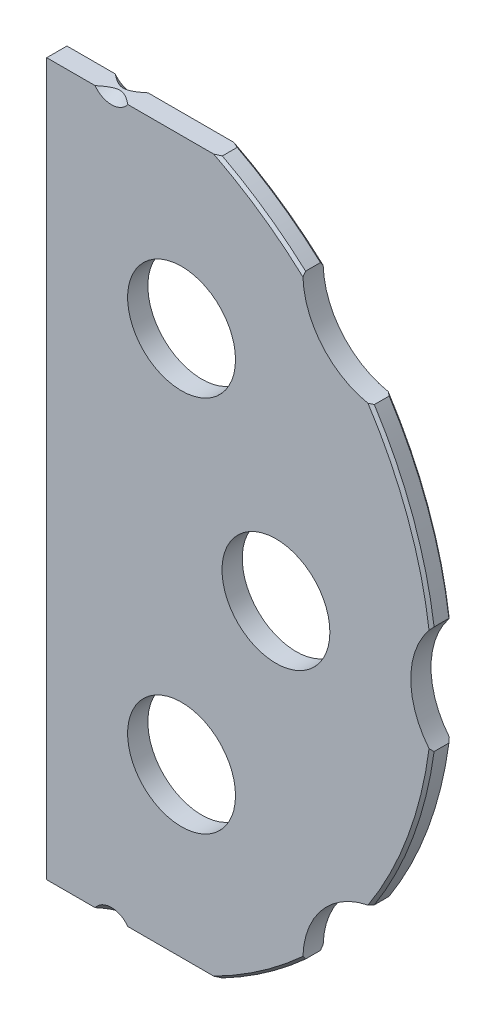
ISO-10303-21;
HEADER;
FILE_DESCRIPTION(('STEP AP214'),'2;1');
FILE_NAME('part.step','',(''),(''),'','','');
FILE_SCHEMA(('AUTOMOTIVE_DESIGN { 1 0 10303 214 1 1 1 1 }'));
ENDSEC;
DATA;
#1=APPLICATION_CONTEXT('core data for automotive mechanical design processes');
#2=APPLICATION_PROTOCOL_DEFINITION('international standard','automotive_design',2000,#1);
#3=PRODUCT_CONTEXT('',#1,'mechanical');
#4=PRODUCT('Part','Part','',(#3));
#5=PRODUCT_RELATED_PRODUCT_CATEGORY('part','',(#4));
#6=PRODUCT_DEFINITION_FORMATION('','',#4);
#7=PRODUCT_DEFINITION_CONTEXT('part definition',#1,'design');
#8=PRODUCT_DEFINITION('design','',#6,#7);
#9=PRODUCT_DEFINITION_SHAPE('','',#8);
#10=(LENGTH_UNIT() NAMED_UNIT(*) SI_UNIT(.MILLI.,.METRE.));
#11=(NAMED_UNIT(*) PLANE_ANGLE_UNIT() SI_UNIT($,.RADIAN.));
#12=(NAMED_UNIT(*) SI_UNIT($,.STERADIAN.) SOLID_ANGLE_UNIT());
#13=UNCERTAINTY_MEASURE_WITH_UNIT(LENGTH_MEASURE(1.E-05),#10,'distance_accuracy_value','');
#14=(GEOMETRIC_REPRESENTATION_CONTEXT(3) GLOBAL_UNCERTAINTY_ASSIGNED_CONTEXT((#13)) GLOBAL_UNIT_ASSIGNED_CONTEXT((#10,
#11,#12)) REPRESENTATION_CONTEXT('',''));
#15=CARTESIAN_POINT('',(0.,0.,0.));
#16=DIRECTION('',(0.,0.,1.));
#17=DIRECTION('',(1.,0.,0.));
#18=AXIS2_PLACEMENT_3D('',#15,#16,#17);
#19=CARTESIAN_POINT('',(6.34999999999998,167.64,-4.7625));
#20=DIRECTION('',(0.,1.,0.));
#21=DIRECTION('',(0.,0.,1.));
#22=AXIS2_PLACEMENT_3D('',#19,#20,#21);
#23=PLANE('',#22);
#24=DIRECTION('',(0.,0.,1.));
#25=VECTOR('',#24,1.);
#26=CARTESIAN_POINT('',(87.7771228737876,167.64,-4.7625));
#27=LINE('',#26,#25);
#28=CARTESIAN_POINT('',(87.7771228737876,167.64,-3.4925));
#29=VERTEX_POINT('',#28);
#30=CARTESIAN_POINT('',(87.7771228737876,167.64,3.4925));
#31=VERTEX_POINT('',#30);
#32=EDGE_CURVE('E598',#29,#31,#27,.T.);
#33=ORIENTED_EDGE('',*,*,#32,.F.);
#34=CARTESIAN_POINT('',(136.639538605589,167.64,23.5493962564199));
#35=CARTESIAN_POINT('',(134.989862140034,167.64,22.5071574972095));
#36=CARTESIAN_POINT('',(133.335070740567,167.64,21.4729908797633));
#37=CARTESIAN_POINT('',(130.014724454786,167.64,19.4220061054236));
#38=CARTESIAN_POINT('',(128.349169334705,167.64,18.405188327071));
#39=CARTESIAN_POINT('',(125.006430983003,167.64,16.3899080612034));
#40=CARTESIAN_POINT('',(123.329245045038,167.64,15.3914500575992));
#41=CARTESIAN_POINT('',(119.963156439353,167.64,13.4145258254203));
#42=CARTESIAN_POINT('',(118.27425383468,167.64,12.4360594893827));
#43=CARTESIAN_POINT('',(113.174287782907,167.64,9.52430409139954));
#44=CARTESIAN_POINT('',(109.744565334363,167.64,7.62349175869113));
#45=CARTESIAN_POINT('',(102.831736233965,167.64,3.92188896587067));
#46=CARTESIAN_POINT('',(99.3486330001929,167.64,2.12109213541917));
#47=CARTESIAN_POINT('',(92.2614322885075,167.64,-1.3963205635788));
#48=CARTESIAN_POINT('',(88.6562856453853,167.64,-3.11083098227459));
#49=CARTESIAN_POINT('',(81.3825647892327,167.64,-6.40081181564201));
#50=CARTESIAN_POINT('',(77.7139869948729,167.64,-7.97627434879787));
#51=CARTESIAN_POINT('',(70.3173988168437,167.64,-10.9636512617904));
#52=CARTESIAN_POINT('',(66.5894932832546,167.64,-12.3758241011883));
#53=CARTESIAN_POINT('',(59.0688264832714,167.64,-15.0151412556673));
#54=CARTESIAN_POINT('',(55.2760758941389,167.64,-16.242315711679));
#55=CARTESIAN_POINT('',(49.0065541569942,167.64,-18.081889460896));
#56=CARTESIAN_POINT('',(46.5479429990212,167.64,-18.7564952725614));
#57=CARTESIAN_POINT('',(41.6070850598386,167.64,-20.0128820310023));
#58=CARTESIAN_POINT('',(39.1248391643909,167.64,-20.5946664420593));
#59=CARTESIAN_POINT('',(34.1387218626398,167.64,-21.6590927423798));
#60=CARTESIAN_POINT('',(31.6348471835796,167.64,-22.1417193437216));
#61=CARTESIAN_POINT('',(26.6090426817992,167.64,-23.0019008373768));
#62=CARTESIAN_POINT('',(24.0871128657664,167.64,-23.3794557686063));
#63=CARTESIAN_POINT('',(19.0499217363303,167.64,-24.021935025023));
#64=CARTESIAN_POINT('',(16.5347753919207,167.64,-24.2877577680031));
#65=CARTESIAN_POINT('',(11.4950830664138,167.64,-24.707615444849));
#66=CARTESIAN_POINT('',(8.97053693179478,167.64,-24.8616485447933));
#67=CARTESIAN_POINT('',(3.91781903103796,167.64,-25.0557249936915));
#68=CARTESIAN_POINT('',(1.38964855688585,167.64,-25.0958020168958));
#69=CARTESIAN_POINT('',(-3.6657816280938,167.64,-25.0614720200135));
#70=CARTESIAN_POINT('',(-6.19304139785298,167.64,-24.9870746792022));
#71=CARTESIAN_POINT('',(-10.1369194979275,167.64,-24.7822890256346));
#72=CARTESIAN_POINT('',(-11.5556649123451,167.64,-24.690641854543));
#73=CARTESIAN_POINT('',(-14.3903717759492,167.64,-24.4719244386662));
#74=CARTESIAN_POINT('',(-15.8063333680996,167.64,-24.3448560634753));
#75=CARTESIAN_POINT('',(-18.6344956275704,167.64,-24.0558603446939));
#76=CARTESIAN_POINT('',(-20.0466967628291,167.64,-23.8939375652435));
#77=CARTESIAN_POINT('',(-22.8667611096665,167.64,-23.535910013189));
#78=CARTESIAN_POINT('',(-24.2746243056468,167.64,-23.3398051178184));
#79=CARTESIAN_POINT('',(-27.0945776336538,167.64,-22.9128110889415));
#80=CARTESIAN_POINT('',(-28.5066342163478,167.64,-22.6817006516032));
#81=CARTESIAN_POINT('',(-31.3249725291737,167.64,-22.1865832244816));
#82=CARTESIAN_POINT('',(-32.7312542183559,167.64,-21.9225760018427));
#83=CARTESIAN_POINT('',(-35.5374160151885,167.64,-21.3626809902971));
#84=CARTESIAN_POINT('',(-36.9372962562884,167.64,-21.0667938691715));
#85=CARTESIAN_POINT('',(-39.7301475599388,167.64,-20.4442366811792));
#86=CARTESIAN_POINT('',(-41.1231188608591,167.64,-20.1175676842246));
#87=CARTESIAN_POINT('',(-42.5124157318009,167.64,-19.7760484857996));
#88=B_SPLINE_CURVE_WITH_KNOTS('',3,(#34,#35,#36,#37,#38,#39,#40,#41,#42,#43,#44,#45,#46,#47,#48,
#49,#50,#51,#52,#53,#54,#55,#56,#57,#58,#59,#60,#61,#62,#63,#64,#65,#66,#67,#68,#69,#70,#71,#72,
#73,#74,#75,#76,#77,#78,#79,#80,#81,#82,#83,#84,#85,#86,#87),.UNSPECIFIED.,.F.,.F.,(4,2,2,2,2,2,
2,2,2,2,2,2,2,2,2,2,2,2,2,2,2,2,2,2,2,2,4),(0.,5.8539884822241,11.7081045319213,
17.5636318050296,23.4191275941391,35.1812958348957,46.9427140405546,58.91636903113,
70.8907022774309,82.8458149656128,94.798977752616,102.44586030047,110.092457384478,
117.740232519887,125.388004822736,132.973048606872,140.558216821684,148.141143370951,
155.723428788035,159.988152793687,164.252651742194,168.516592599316,172.780548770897,
177.072682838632,181.364847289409,185.656921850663,189.948847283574),.UNSPECIFIED.);
#89=CARTESIAN_POINT('',(85.004658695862,167.64,-4.7625));
#90=VERTEX_POINT('',#89);
#91=EDGE_CURVE('E582',#29,#90,#88,.T.);
#92=ORIENTED_EDGE('',*,*,#91,.T.);
#93=DIRECTION('',(-1.,0.,0.));
#94=VECTOR('',#93,1.);
#95=CARTESIAN_POINT('',(6.34999999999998,167.64,-4.7625));
#96=LINE('',#95,#94);
#97=CARTESIAN_POINT('',(44.5436165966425,167.64,-4.7625));
#98=VERTEX_POINT('',#97);
#99=EDGE_CURVE('E595',#90,#98,#96,.T.);
#100=ORIENTED_EDGE('',*,*,#99,.T.);
#101=CARTESIAN_POINT('',(-9.07491037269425,167.64,-41.4812729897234));
#102=CARTESIAN_POINT('',(-8.34244029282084,167.64,-40.7541723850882));
#103=CARTESIAN_POINT('',(-7.60984541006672,167.64,-40.0271974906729));
#104=CARTESIAN_POINT('',(-6.14436066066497,167.64,-38.5735444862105));
#105=CARTESIAN_POINT('',(-5.41147079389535,167.64,-37.8468663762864));
#106=CARTESIAN_POINT('',(-3.21205191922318,167.64,-35.6671086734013));
#107=CARTESIAN_POINT('',(-1.7450130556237,167.64,-34.2145434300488));
#108=CARTESIAN_POINT('',(1.19635445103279,167.64,-31.3059626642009));
#109=CARTESIAN_POINT('',(2.67069003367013,167.64,-29.8499541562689));
#110=CARTESIAN_POINT('',(4.88415074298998,167.64,-27.668160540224));
#111=CARTESIAN_POINT('',(5.62223871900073,167.64,-26.9413232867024));
#112=CARTESIAN_POINT('',(7.09926873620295,167.64,-25.4885219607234));
#113=CARTESIAN_POINT('',(7.83821077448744,167.64,-24.7625578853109));
#114=CARTESIAN_POINT('',(9.42505344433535,167.64,-23.2058707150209));
#115=CARTESIAN_POINT('',(10.2731207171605,167.64,-22.3753174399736));
#116=CARTESIAN_POINT('',(11.9711031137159,167.64,-20.7160774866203));
#117=CARTESIAN_POINT('',(12.8210182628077,167.64,-19.8873908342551));
#118=CARTESIAN_POINT('',(14.5237691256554,167.64,-18.2321460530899));
#119=CARTESIAN_POINT('',(15.37660611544,167.64,-17.4055892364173));
#120=CARTESIAN_POINT('',(17.0856981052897,167.64,-15.7560961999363));
#121=CARTESIAN_POINT('',(17.9419529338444,167.64,-14.933159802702));
#122=CARTESIAN_POINT('',(19.229060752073,167.64,-13.70376438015));
#123=CARTESIAN_POINT('',(19.6580092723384,167.64,-13.2953118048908));
#124=CARTESIAN_POINT('',(20.5174715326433,167.64,-12.4800564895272));
#125=CARTESIAN_POINT('',(20.9479852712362,167.64,-12.0732537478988));
#126=CARTESIAN_POINT('',(21.8110499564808,167.64,-11.2616397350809));
#127=CARTESIAN_POINT('',(22.2436012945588,167.64,-10.8568288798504));
#128=CARTESIAN_POINT('',(23.1111780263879,167.64,-10.0498732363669));
#129=CARTESIAN_POINT('',(23.5462033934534,167.64,-9.64772841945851));
#130=CARTESIAN_POINT('',(24.4190685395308,167.64,-8.84730060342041));
#131=CARTESIAN_POINT('',(24.8569054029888,167.64,-8.44901442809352));
#132=CARTESIAN_POINT('',(25.7368123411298,167.64,-7.65714537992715));
#133=CARTESIAN_POINT('',(26.1788823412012,167.64,-7.26356242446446));
#134=CARTESIAN_POINT('',(26.8462607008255,167.64,-6.67819426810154));
#135=CARTESIAN_POINT('',(27.0693986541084,167.64,-6.48393463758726));
#136=CARTESIAN_POINT('',(27.5173912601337,167.64,-6.09740651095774));
#137=CARTESIAN_POINT('',(27.7422458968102,167.64,-5.90513799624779));
#138=CARTESIAN_POINT('',(28.1939770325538,167.64,-5.52303001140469));
#139=CARTESIAN_POINT('',(28.4208533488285,167.64,-5.33319032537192));
#140=CARTESIAN_POINT('',(28.8770530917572,167.64,-4.95647802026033));
#141=CARTESIAN_POINT('',(29.1063764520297,167.64,-4.76960532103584));
#142=CARTESIAN_POINT('',(29.4170571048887,167.64,-4.52055970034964));
#143=CARTESIAN_POINT('',(29.4971077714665,167.64,-4.45675460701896));
#144=CARTESIAN_POINT('',(29.6575927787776,167.64,-4.32962677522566));
#145=CARTESIAN_POINT('',(29.7380271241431,167.64,-4.26630404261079));
#146=CARTESIAN_POINT('',(29.9799497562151,167.64,-4.07711636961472));
#147=CARTESIAN_POINT('',(30.1420530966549,167.64,-3.95203560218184));
#148=CARTESIAN_POINT('',(30.4682098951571,167.64,-3.70430928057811));
#149=CARTESIAN_POINT('',(30.6322640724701,167.64,-3.58166467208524));
#150=CARTESIAN_POINT('',(30.9625589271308,167.64,-3.33935223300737));
#151=CARTESIAN_POINT('',(31.1287995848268,167.64,-3.21968437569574));
#152=CARTESIAN_POINT('',(31.4630745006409,167.64,-2.98447284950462));
#153=CARTESIAN_POINT('',(31.6310974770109,167.64,-2.86891319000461));
#154=CARTESIAN_POINT('',(31.9700579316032,167.64,-2.64215446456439));
#155=CARTESIAN_POINT('',(32.1409952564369,167.64,-2.53095517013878));
#156=CARTESIAN_POINT('',(32.4861669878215,167.64,-2.31398337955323));
#157=CARTESIAN_POINT('',(32.6603995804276,167.64,-2.20820801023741));
#158=CARTESIAN_POINT('',(33.0127431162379,167.64,-2.00334416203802));
#159=CARTESIAN_POINT('',(33.1908535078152,167.64,-1.90425474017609));
#160=CARTESIAN_POINT('',(33.5454915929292,167.64,-1.71760598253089));
#161=CARTESIAN_POINT('',(33.7218739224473,167.64,-1.6297723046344));
#162=CARTESIAN_POINT('',(34.0792167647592,167.64,-1.46385655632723));
#163=CARTESIAN_POINT('',(34.2601774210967,167.64,-1.38577479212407));
#164=CARTESIAN_POINT('',(34.6265473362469,167.64,-1.24188468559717));
#165=CARTESIAN_POINT('',(34.811946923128,167.64,-1.17605199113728));
#166=CARTESIAN_POINT('',(35.187342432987,167.64,-1.05921069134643));
#167=CARTESIAN_POINT('',(35.3773360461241,167.64,-1.00819479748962));
#168=CARTESIAN_POINT('',(35.7298123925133,167.64,-0.930621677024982));
#169=CARTESIAN_POINT('',(35.891711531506,167.64,-0.901428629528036));
#170=CARTESIAN_POINT('',(36.2173867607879,167.64,-0.856668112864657));
#171=CARTESIAN_POINT('',(36.3811625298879,167.64,-0.841098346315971));
#172=CARTESIAN_POINT('',(36.7091103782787,167.64,-0.824413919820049));
#173=CARTESIAN_POINT('',(36.8732808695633,167.64,-0.823268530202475));
#174=CARTESIAN_POINT('',(37.2010952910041,167.64,-0.835410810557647));
#175=CARTESIAN_POINT('',(37.36473914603,167.64,-0.848700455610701));
#176=CARTESIAN_POINT('',(37.7265324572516,167.64,-0.893519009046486));
#177=CARTESIAN_POINT('',(37.9242607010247,167.64,-0.928447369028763));
#178=CARTESIAN_POINT('',(38.3156728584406,167.64,-1.01647124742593));
#179=CARTESIAN_POINT('',(38.509354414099,167.64,-1.06957706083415));
#180=CARTESIAN_POINT('',(38.7967673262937,167.64,-1.16080841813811));
#181=CARTESIAN_POINT('',(38.8923520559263,167.64,-1.19326938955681));
#182=CARTESIAN_POINT('',(39.0822315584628,167.64,-1.26165580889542));
#183=CARTESIAN_POINT('',(39.1765268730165,167.64,-1.29757974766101));
#184=CARTESIAN_POINT('',(39.3638509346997,167.64,-1.37254483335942));
#185=CARTESIAN_POINT('',(39.4568798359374,167.64,-1.41158559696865));
#186=CARTESIAN_POINT('',(39.6417193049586,167.64,-1.49246652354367));
#187=CARTESIAN_POINT('',(39.7335297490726,167.64,-1.53430696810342));
#188=CARTESIAN_POINT('',(40.0021652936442,167.64,-1.66119808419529));
#189=CARTESIAN_POINT('',(40.1773543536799,167.64,-1.74972358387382));
#190=CARTESIAN_POINT('',(40.5237151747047,167.64,-1.93435042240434));
#191=CARTESIAN_POINT('',(40.6948857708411,167.64,-2.03045392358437));
#192=CARTESIAN_POINT('',(41.0338222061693,167.64,-2.22884962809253));
#193=CARTESIAN_POINT('',(41.2015843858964,167.64,-2.33114805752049));
#194=CARTESIAN_POINT('',(41.533964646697,167.64,-2.54067680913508));
#195=CARTESIAN_POINT('',(41.6985830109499,167.64,-2.64790668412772));
#196=CARTESIAN_POINT('',(42.0257539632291,167.64,-2.86683581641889));
#197=CARTESIAN_POINT('',(42.1882958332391,167.64,-2.9785510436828));
#198=CARTESIAN_POINT('',(42.5110192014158,167.64,-3.2053461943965));
#199=CARTESIAN_POINT('',(42.6712005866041,167.64,-3.32042627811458));
#200=CARTESIAN_POINT('',(43.1485057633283,167.64,-3.66970319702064));
#201=CARTESIAN_POINT('',(43.4625808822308,167.64,-3.90806600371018));
#202=CARTESIAN_POINT('',(44.0896367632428,167.64,-4.39659135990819));
#203=CARTESIAN_POINT('',(44.4025161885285,167.64,-4.64688293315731));
#204=CARTESIAN_POINT('',(45.0234400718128,167.64,-5.15344637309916));
#205=CARTESIAN_POINT('',(45.3314839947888,167.64,-5.40971889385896));
#206=CARTESIAN_POINT('',(45.9429913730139,167.64,-5.9260749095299));
#207=CARTESIAN_POINT('',(46.2464645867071,167.64,-6.18614688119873));
#208=CARTESIAN_POINT('',(46.8504115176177,167.64,-6.70971681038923));
#209=CARTESIAN_POINT('',(47.1508853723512,167.64,-6.97321460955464));
#210=CARTESIAN_POINT('',(47.7554616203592,167.64,-7.50824761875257));
#211=CARTESIAN_POINT('',(48.0595152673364,167.64,-7.77983783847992));
#212=CARTESIAN_POINT('',(48.6655977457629,167.64,-8.32526973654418));
#213=CARTESIAN_POINT('',(48.9676265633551,167.64,-8.59911143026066));
#214=CARTESIAN_POINT('',(49.8712547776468,167.64,-9.42336485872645));
#215=CARTESIAN_POINT('',(50.4703787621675,167.64,-9.97648964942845));
#216=CARTESIAN_POINT('',(51.6641100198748,167.64,-11.0877157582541));
#217=CARTESIAN_POINT('',(52.2587167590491,167.64,-11.6458176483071));
#218=CARTESIAN_POINT('',(53.4446004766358,167.64,-12.7655515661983));
#219=CARTESIAN_POINT('',(54.0358774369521,167.64,-13.3271836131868));
#220=CARTESIAN_POINT('',(55.2168114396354,167.64,-14.4538812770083));
#221=CARTESIAN_POINT('',(55.8064648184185,167.64,-15.0189507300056));
#222=CARTESIAN_POINT('',(56.9838618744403,167.64,-16.1510789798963));
#223=CARTESIAN_POINT('',(57.5716055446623,167.64,-16.7181377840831));
#224=CARTESIAN_POINT('',(58.7455561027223,167.64,-17.8537602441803));
#225=CARTESIAN_POINT('',(59.3317630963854,167.64,-18.4223237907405));
#226=CARTESIAN_POINT('',(60.5029842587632,167.64,-19.5606783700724));
#227=CARTESIAN_POINT('',(61.0879984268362,167.64,-20.1304694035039));
#228=CARTESIAN_POINT('',(62.729384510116,167.64,-21.7318349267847));
#229=CARTESIAN_POINT('',(63.7846684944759,167.64,-22.7645244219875));
#230=CARTESIAN_POINT('',(65.8930542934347,167.64,-24.8321723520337));
#231=CARTESIAN_POINT('',(66.9461560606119,167.64,-25.8671308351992));
#232=CARTESIAN_POINT('',(69.0488716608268,167.64,-27.9368408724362));
#233=CARTESIAN_POINT('',(70.0984883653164,167.64,-28.9715895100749));
#234=CARTESIAN_POINT('',(72.1964605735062,167.64,-31.0423146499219));
#235=CARTESIAN_POINT('',(73.2448161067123,167.64,-32.0782911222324));
#236=CARTESIAN_POINT('',(74.2927391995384,167.64,-33.1147038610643));
#237=B_SPLINE_CURVE_WITH_KNOTS('',3,(#101,#102,#103,#104,#105,#106,#107,#108,#109,#110,#111,
#112,#113,#114,#115,#116,#117,#118,#119,#120,#121,#122,#123,#124,#125,#126,#127,#128,#129,#130,
#131,#132,#133,#134,#135,#136,#137,#138,#139,#140,#141,#142,#143,#144,#145,#146,#147,#148,#149,
#150,#151,#152,#153,#154,#155,#156,#157,#158,#159,#160,#161,#162,#163,#164,#165,#166,#167,#168,
#169,#170,#171,#172,#173,#174,#175,#176,#177,#178,#179,#180,#181,#182,#183,#184,#185,#186,#187,
#188,#189,#190,#191,#192,#193,#194,#195,#196,#197,#198,#199,#200,#201,#202,#203,#204,#205,#206,
#207,#208,#209,#210,#211,#212,#213,#214,#215,#216,#217,#218,#219,#220,#221,#222,#223,#224,#225,
#226,#227,#228,#229,#230,#231,#232,#233,#234,#235,#236),.UNSPECIFIED.,.F.,.F.,(4,2,2,2,2,2,2,2,
2,2,2,2,2,2,2,2,2,2,2,2,2,2,2,2,2,2,2,2,2,2,2,2,2,2,2,2,2,2,2,2,2,2,2,2,2,2,2,2,2,2,2,2,2,2,2,2,
2,2,2,2,2,2,2,2,2,2,2,4),(0.,3.09623792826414,6.19247713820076,12.3859677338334,
18.6022848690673,21.7099516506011,24.8176078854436,28.3786915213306,31.9398243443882,
35.5027865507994,39.0655721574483,40.8424968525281,42.6194199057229,44.3966994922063,
46.1739599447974,47.9496059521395,49.7252207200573,50.6127623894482,51.5002957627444,
52.3877496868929,53.2751795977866,53.5822819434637,53.8893880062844,54.5036176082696,
55.118081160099,55.7325391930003,56.3442613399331,56.9559513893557,57.5673139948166,
58.1785901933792,58.7694774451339,59.3603832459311,59.9501014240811,60.5395290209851,
61.0325398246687,61.5254674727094,62.0173448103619,62.5092894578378,63.1106573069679,
63.7123663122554,64.0151508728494,64.3178040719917,64.6204201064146,64.9230666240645,
65.5116657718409,66.1004334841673,66.6898030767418,67.2791193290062,67.8707615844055,
68.4624320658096,69.6450832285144,70.8470170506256,72.0490829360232,73.2480509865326,
74.4469638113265,75.6700152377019,76.8930750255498,79.3392635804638,81.7857369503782,
84.2322236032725,86.6823099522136,89.1324052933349,91.5823272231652,94.0322504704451,
98.461764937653,102.891374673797,107.313092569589,111.734704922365),.UNSPECIFIED.);
#238=CARTESIAN_POINT('',(29.1163834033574,167.64,-4.76249999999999));
#239=VERTEX_POINT('',#238);
#240=EDGE_CURVE('E672',#98,#239,#237,.F.);
#241=ORIENTED_EDGE('',*,*,#240,.T.);
#242=CARTESIAN_POINT('',(6.34999999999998,167.64,-4.7625));
#243=VERTEX_POINT('',#242);
#244=EDGE_CURVE('E607',#239,#243,#96,.T.);
#245=ORIENTED_EDGE('',*,*,#244,.T.);
#246=DIRECTION('',(0.,0.,1.));
#247=VECTOR('',#246,1.);
#248=CARTESIAN_POINT('',(6.34999999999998,167.64,-4.7625));
#249=LINE('',#248,#247);
#250=CARTESIAN_POINT('',(6.34999999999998,167.64,4.7625));
#251=VERTEX_POINT('',#250);
#252=EDGE_CURVE('E619',#243,#251,#249,.T.);
#253=ORIENTED_EDGE('',*,*,#252,.T.);
#254=DIRECTION('',(-1.,0.,0.));
#255=VECTOR('',#254,1.);
#256=CARTESIAN_POINT('',(6.34999999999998,167.64,4.7625));
#257=LINE('',#256,#255);
#258=CARTESIAN_POINT('',(29.1163834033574,167.64,4.76249999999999));
#259=VERTEX_POINT('',#258);
#260=EDGE_CURVE('E810',#259,#251,#257,.T.);
#261=ORIENTED_EDGE('',*,*,#260,.F.);
#262=CARTESIAN_POINT('',(-9.07491037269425,167.64,41.4812729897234));
#263=CARTESIAN_POINT('',(-8.34244029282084,167.64,40.7541723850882));
#264=CARTESIAN_POINT('',(-7.60984541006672,167.64,40.0271974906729));
#265=CARTESIAN_POINT('',(-6.14436066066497,167.64,38.5735444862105));
#266=CARTESIAN_POINT('',(-5.41147079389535,167.64,37.8468663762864));
#267=CARTESIAN_POINT('',(-3.21205191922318,167.64,35.6671086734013));
#268=CARTESIAN_POINT('',(-1.7450130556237,167.64,34.2145434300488));
#269=CARTESIAN_POINT('',(1.19635445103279,167.64,31.3059626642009));
#270=CARTESIAN_POINT('',(2.67069003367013,167.64,29.8499541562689));
#271=CARTESIAN_POINT('',(4.88415074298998,167.64,27.668160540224));
#272=CARTESIAN_POINT('',(5.62223871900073,167.64,26.9413232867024));
#273=CARTESIAN_POINT('',(7.09926873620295,167.64,25.4885219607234));
#274=CARTESIAN_POINT('',(7.83821077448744,167.64,24.7625578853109));
#275=CARTESIAN_POINT('',(9.42505344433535,167.64,23.2058707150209));
#276=CARTESIAN_POINT('',(10.2731207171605,167.64,22.3753174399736));
#277=CARTESIAN_POINT('',(11.9711031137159,167.64,20.7160774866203));
#278=CARTESIAN_POINT('',(12.8210182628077,167.64,19.8873908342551));
#279=CARTESIAN_POINT('',(14.5237691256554,167.64,18.2321460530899));
#280=CARTESIAN_POINT('',(15.37660611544,167.64,17.4055892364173));
#281=CARTESIAN_POINT('',(17.0856981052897,167.64,15.7560961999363));
#282=CARTESIAN_POINT('',(17.9419529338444,167.64,14.933159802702));
#283=CARTESIAN_POINT('',(19.229060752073,167.64,13.70376438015));
#284=CARTESIAN_POINT('',(19.6580092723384,167.64,13.2953118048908));
#285=CARTESIAN_POINT('',(20.5174715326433,167.64,12.4800564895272));
#286=CARTESIAN_POINT('',(20.9479852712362,167.64,12.0732537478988));
#287=CARTESIAN_POINT('',(21.8110499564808,167.64,11.2616397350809));
#288=CARTESIAN_POINT('',(22.2436012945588,167.64,10.8568288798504));
#289=CARTESIAN_POINT('',(23.1111780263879,167.64,10.0498732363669));
#290=CARTESIAN_POINT('',(23.5462033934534,167.64,9.64772841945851));
#291=CARTESIAN_POINT('',(24.4190685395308,167.64,8.84730060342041));
#292=CARTESIAN_POINT('',(24.8569054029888,167.64,8.44901442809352));
#293=CARTESIAN_POINT('',(25.7368123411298,167.64,7.65714537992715));
#294=CARTESIAN_POINT('',(26.1788823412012,167.64,7.26356242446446));
#295=CARTESIAN_POINT('',(26.8462607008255,167.64,6.67819426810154));
#296=CARTESIAN_POINT('',(27.0693986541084,167.64,6.48393463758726));
#297=CARTESIAN_POINT('',(27.5173912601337,167.64,6.09740651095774));
#298=CARTESIAN_POINT('',(27.7422458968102,167.64,5.90513799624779));
#299=CARTESIAN_POINT('',(28.1939770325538,167.64,5.52303001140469));
#300=CARTESIAN_POINT('',(28.4208533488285,167.64,5.33319032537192));
#301=CARTESIAN_POINT('',(28.8770530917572,167.64,4.95647802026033));
#302=CARTESIAN_POINT('',(29.1063764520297,167.64,4.76960532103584));
#303=CARTESIAN_POINT('',(29.4170571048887,167.64,4.52055970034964));
#304=CARTESIAN_POINT('',(29.4971077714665,167.64,4.45675460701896));
#305=CARTESIAN_POINT('',(29.6575927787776,167.64,4.32962677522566));
#306=CARTESIAN_POINT('',(29.7380271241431,167.64,4.26630404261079));
#307=CARTESIAN_POINT('',(29.9799497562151,167.64,4.07711636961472));
#308=CARTESIAN_POINT('',(30.1420530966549,167.64,3.95203560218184));
#309=CARTESIAN_POINT('',(30.4682098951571,167.64,3.70430928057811));
#310=CARTESIAN_POINT('',(30.6322640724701,167.64,3.58166467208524));
#311=CARTESIAN_POINT('',(30.9625589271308,167.64,3.33935223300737));
#312=CARTESIAN_POINT('',(31.1287995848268,167.64,3.21968437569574));
#313=CARTESIAN_POINT('',(31.4630745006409,167.64,2.98447284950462));
#314=CARTESIAN_POINT('',(31.6310974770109,167.64,2.86891319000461));
#315=CARTESIAN_POINT('',(31.9700579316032,167.64,2.64215446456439));
#316=CARTESIAN_POINT('',(32.1409952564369,167.64,2.53095517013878));
#317=CARTESIAN_POINT('',(32.4861669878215,167.64,2.31398337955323));
#318=CARTESIAN_POINT('',(32.6603995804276,167.64,2.20820801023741));
#319=CARTESIAN_POINT('',(33.0127431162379,167.64,2.00334416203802));
#320=CARTESIAN_POINT('',(33.1908535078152,167.64,1.90425474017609));
#321=CARTESIAN_POINT('',(33.5454915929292,167.64,1.71760598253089));
#322=CARTESIAN_POINT('',(33.7218739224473,167.64,1.6297723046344));
#323=CARTESIAN_POINT('',(34.0792167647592,167.64,1.46385655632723));
#324=CARTESIAN_POINT('',(34.2601774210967,167.64,1.38577479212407));
#325=CARTESIAN_POINT('',(34.6265473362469,167.64,1.24188468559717));
#326=CARTESIAN_POINT('',(34.811946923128,167.64,1.17605199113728));
#327=CARTESIAN_POINT('',(35.187342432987,167.64,1.05921069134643));
#328=CARTESIAN_POINT('',(35.3773360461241,167.64,1.00819479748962));
#329=CARTESIAN_POINT('',(35.7298123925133,167.64,0.930621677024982));
#330=CARTESIAN_POINT('',(35.891711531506,167.64,0.901428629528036));
#331=CARTESIAN_POINT('',(36.2173867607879,167.64,0.856668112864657));
#332=CARTESIAN_POINT('',(36.3811625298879,167.64,0.841098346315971));
#333=CARTESIAN_POINT('',(36.7091103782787,167.64,0.824413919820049));
#334=CARTESIAN_POINT('',(36.8732808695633,167.64,0.823268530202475));
#335=CARTESIAN_POINT('',(37.2010952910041,167.64,0.835410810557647));
#336=CARTESIAN_POINT('',(37.36473914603,167.64,0.848700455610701));
#337=CARTESIAN_POINT('',(37.7265324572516,167.64,0.893519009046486));
#338=CARTESIAN_POINT('',(37.9242607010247,167.64,0.928447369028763));
#339=CARTESIAN_POINT('',(38.3156728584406,167.64,1.01647124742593));
#340=CARTESIAN_POINT('',(38.509354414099,167.64,1.06957706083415));
#341=CARTESIAN_POINT('',(38.7967673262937,167.64,1.16080841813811));
#342=CARTESIAN_POINT('',(38.8923520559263,167.64,1.19326938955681));
#343=CARTESIAN_POINT('',(39.0822315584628,167.64,1.26165580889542));
#344=CARTESIAN_POINT('',(39.1765268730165,167.64,1.29757974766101));
#345=CARTESIAN_POINT('',(39.3638509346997,167.64,1.37254483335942));
#346=CARTESIAN_POINT('',(39.4568798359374,167.64,1.41158559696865));
#347=CARTESIAN_POINT('',(39.6417193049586,167.64,1.49246652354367));
#348=CARTESIAN_POINT('',(39.7335297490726,167.64,1.53430696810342));
#349=CARTESIAN_POINT('',(40.0021652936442,167.64,1.66119808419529));
#350=CARTESIAN_POINT('',(40.1773543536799,167.64,1.74972358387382));
#351=CARTESIAN_POINT('',(40.5237151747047,167.64,1.93435042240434));
#352=CARTESIAN_POINT('',(40.6948857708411,167.64,2.03045392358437));
#353=CARTESIAN_POINT('',(41.0338222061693,167.64,2.22884962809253));
#354=CARTESIAN_POINT('',(41.2015843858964,167.64,2.33114805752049));
#355=CARTESIAN_POINT('',(41.533964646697,167.64,2.54067680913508));
#356=CARTESIAN_POINT('',(41.6985830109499,167.64,2.64790668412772));
#357=CARTESIAN_POINT('',(42.0257539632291,167.64,2.86683581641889));
#358=CARTESIAN_POINT('',(42.1882958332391,167.64,2.9785510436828));
#359=CARTESIAN_POINT('',(42.5110192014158,167.64,3.2053461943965));
#360=CARTESIAN_POINT('',(42.6712005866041,167.64,3.32042627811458));
#361=CARTESIAN_POINT('',(43.1485057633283,167.64,3.66970319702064));
#362=CARTESIAN_POINT('',(43.4625808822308,167.64,3.90806600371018));
#363=CARTESIAN_POINT('',(44.0896367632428,167.64,4.39659135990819));
#364=CARTESIAN_POINT('',(44.4025161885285,167.64,4.64688293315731));
#365=CARTESIAN_POINT('',(45.0234400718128,167.64,5.15344637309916));
#366=CARTESIAN_POINT('',(45.3314839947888,167.64,5.40971889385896));
#367=CARTESIAN_POINT('',(45.9429913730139,167.64,5.9260749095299));
#368=CARTESIAN_POINT('',(46.2464645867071,167.64,6.18614688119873));
#369=CARTESIAN_POINT('',(46.8504115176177,167.64,6.70971681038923));
#370=CARTESIAN_POINT('',(47.1508853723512,167.64,6.97321460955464));
#371=CARTESIAN_POINT('',(47.7554616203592,167.64,7.50824761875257));
#372=CARTESIAN_POINT('',(48.0595152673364,167.64,7.77983783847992));
#373=CARTESIAN_POINT('',(48.6655977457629,167.64,8.32526973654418));
#374=CARTESIAN_POINT('',(48.9676265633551,167.64,8.59911143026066));
#375=CARTESIAN_POINT('',(49.8712547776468,167.64,9.42336485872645));
#376=CARTESIAN_POINT('',(50.4703787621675,167.64,9.97648964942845));
#377=CARTESIAN_POINT('',(51.6641100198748,167.64,11.0877157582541));
#378=CARTESIAN_POINT('',(52.2587167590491,167.64,11.6458176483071));
#379=CARTESIAN_POINT('',(53.4446004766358,167.64,12.7655515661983));
#380=CARTESIAN_POINT('',(54.0358774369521,167.64,13.3271836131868));
#381=CARTESIAN_POINT('',(55.2168114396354,167.64,14.4538812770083));
#382=CARTESIAN_POINT('',(55.8064648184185,167.64,15.0189507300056));
#383=CARTESIAN_POINT('',(56.9838618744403,167.64,16.1510789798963));
#384=CARTESIAN_POINT('',(57.5716055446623,167.64,16.7181377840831));
#385=CARTESIAN_POINT('',(58.7455561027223,167.64,17.8537602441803));
#386=CARTESIAN_POINT('',(59.3317630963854,167.64,18.4223237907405));
#387=CARTESIAN_POINT('',(60.5029842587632,167.64,19.5606783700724));
#388=CARTESIAN_POINT('',(61.0879984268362,167.64,20.1304694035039));
#389=CARTESIAN_POINT('',(62.729384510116,167.64,21.7318349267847));
#390=CARTESIAN_POINT('',(63.7846684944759,167.64,22.7645244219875));
#391=CARTESIAN_POINT('',(65.8930542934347,167.64,24.8321723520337));
#392=CARTESIAN_POINT('',(66.9461560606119,167.64,25.8671308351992));
#393=CARTESIAN_POINT('',(69.0488716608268,167.64,27.9368408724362));
#394=CARTESIAN_POINT('',(70.0984883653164,167.64,28.9715895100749));
#395=CARTESIAN_POINT('',(72.1964605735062,167.64,31.0423146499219));
#396=CARTESIAN_POINT('',(73.2448161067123,167.64,32.0782911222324));
#397=CARTESIAN_POINT('',(74.2927391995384,167.64,33.1147038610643));
#398=B_SPLINE_CURVE_WITH_KNOTS('',3,(#262,#263,#264,#265,#266,#267,#268,#269,#270,#271,#272,
#273,#274,#275,#276,#277,#278,#279,#280,#281,#282,#283,#284,#285,#286,#287,#288,#289,#290,#291,
#292,#293,#294,#295,#296,#297,#298,#299,#300,#301,#302,#303,#304,#305,#306,#307,#308,#309,#310,
#311,#312,#313,#314,#315,#316,#317,#318,#319,#320,#321,#322,#323,#324,#325,#326,#327,#328,#329,
#330,#331,#332,#333,#334,#335,#336,#337,#338,#339,#340,#341,#342,#343,#344,#345,#346,#347,#348,
#349,#350,#351,#352,#353,#354,#355,#356,#357,#358,#359,#360,#361,#362,#363,#364,#365,#366,#367,
#368,#369,#370,#371,#372,#373,#374,#375,#376,#377,#378,#379,#380,#381,#382,#383,#384,#385,#386,
#387,#388,#389,#390,#391,#392,#393,#394,#395,#396,#397),.UNSPECIFIED.,.F.,.F.,(4,2,2,2,2,2,2,2,
2,2,2,2,2,2,2,2,2,2,2,2,2,2,2,2,2,2,2,2,2,2,2,2,2,2,2,2,2,2,2,2,2,2,2,2,2,2,2,2,2,2,2,2,2,2,2,2,
2,2,2,2,2,2,2,2,2,2,2,4),(0.,3.09623792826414,6.19247713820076,12.3859677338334,
18.6022848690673,21.7099516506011,24.8176078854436,28.3786915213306,31.9398243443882,
35.5027865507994,39.0655721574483,40.8424968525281,42.6194199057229,44.3966994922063,
46.1739599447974,47.9496059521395,49.7252207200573,50.6127623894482,51.5002957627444,
52.3877496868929,53.2751795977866,53.5822819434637,53.8893880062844,54.5036176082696,
55.118081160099,55.7325391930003,56.3442613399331,56.9559513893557,57.5673139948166,
58.1785901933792,58.7694774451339,59.3603832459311,59.9501014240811,60.5395290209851,
61.0325398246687,61.5254674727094,62.0173448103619,62.5092894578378,63.1106573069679,
63.7123663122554,64.0151508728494,64.3178040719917,64.6204201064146,64.9230666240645,
65.5116657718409,66.1004334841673,66.6898030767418,67.2791193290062,67.8707615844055,
68.4624320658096,69.6450832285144,70.8470170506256,72.0490829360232,73.2480509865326,
74.4469638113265,75.6700152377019,76.8930750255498,79.3392635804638,81.7857369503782,
84.2322236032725,86.6823099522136,89.1324052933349,91.5823272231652,94.0322504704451,
98.461764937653,102.891374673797,107.313092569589,111.734704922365),.UNSPECIFIED.);
#399=CARTESIAN_POINT('',(44.5436165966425,167.64,4.7625));
#400=VERTEX_POINT('',#399);
#401=EDGE_CURVE('E645',#400,#259,#398,.F.);
#402=ORIENTED_EDGE('',*,*,#401,.F.);
#403=CARTESIAN_POINT('',(85.004658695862,167.64,4.7625));
#404=VERTEX_POINT('',#403);
#405=EDGE_CURVE('E815',#404,#400,#257,.T.);
#406=ORIENTED_EDGE('',*,*,#405,.F.);
#407=CARTESIAN_POINT('',(-42.5124157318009,167.64,19.7760484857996));
#408=CARTESIAN_POINT('',(-41.4668405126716,167.64,20.0330656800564));
#409=CARTESIAN_POINT('',(-40.4192141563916,167.64,20.2816743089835));
#410=CARTESIAN_POINT('',(-38.3199930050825,167.64,20.7616109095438));
#411=CARTESIAN_POINT('',(-37.2683981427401,167.64,20.992938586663));
#412=CARTESIAN_POINT('',(-34.107747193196,167.64,21.6603276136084));
#413=CARTESIAN_POINT('',(-31.992991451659,167.64,22.0697538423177));
#414=CARTESIAN_POINT('',(-27.7495781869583,167.64,22.814160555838));
#415=CARTESIAN_POINT('',(-25.6209155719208,167.64,23.1491119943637));
#416=CARTESIAN_POINT('',(-21.3528481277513,167.64,23.741294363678));
#417=CARTESIAN_POINT('',(-19.2134437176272,167.64,23.9985283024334));
#418=CARTESIAN_POINT('',(-14.9555772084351,167.64,24.4298555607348));
#419=CARTESIAN_POINT('',(-12.8372247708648,167.64,24.6050295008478));
#420=CARTESIAN_POINT('',(-8.59541057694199,167.64,24.875632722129));
#421=CARTESIAN_POINT('',(-6.47194880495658,167.64,24.9710617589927));
#422=CARTESIAN_POINT('',(-2.22332368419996,167.64,25.0812040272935));
#423=CARTESIAN_POINT('',(-0.0981607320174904,167.64,25.095932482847));
#424=CARTESIAN_POINT('',(4.15120727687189,167.64,25.0445706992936));
#425=CARTESIAN_POINT('',(6.27541231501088,167.64,24.9784789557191));
#426=CARTESIAN_POINT('',(10.8606142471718,167.64,24.7490708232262));
#427=CARTESIAN_POINT('',(13.3209250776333,167.64,24.5718477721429));
#428=CARTESIAN_POINT('',(18.2316584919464,167.64,24.1117471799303));
#429=CARTESIAN_POINT('',(20.6820807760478,167.64,23.828866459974));
#430=CARTESIAN_POINT('',(25.5695124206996,167.64,23.1609839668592));
#431=CARTESIAN_POINT('',(28.006518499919,167.64,22.7759582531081));
#432=CARTESIAN_POINT('',(32.86304479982,167.64,21.908448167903));
#433=CARTESIAN_POINT('',(35.2825650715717,167.64,21.4259640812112));
#434=CARTESIAN_POINT('',(40.1207836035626,167.64,20.3646411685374));
#435=CARTESIAN_POINT('',(42.5393181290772,167.64,19.7850572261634));
#436=CARTESIAN_POINT('',(47.3535471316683,167.64,18.5383421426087));
#437=CARTESIAN_POINT('',(49.7492416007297,167.64,17.8712109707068));
#438=CARTESIAN_POINT('',(56.8994251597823,167.64,15.7479168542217));
#439=CARTESIAN_POINT('',(61.6181025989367,167.64,14.1696094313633));
#440=CARTESIAN_POINT('',(69.4075305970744,167.64,11.3054767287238));
#441=CARTESIAN_POINT('',(72.5068831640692,167.64,10.0956989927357));
#442=CARTESIAN_POINT('',(78.66073139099,167.64,7.56631324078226));
#443=CARTESIAN_POINT('',(81.7152243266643,167.64,6.24669858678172));
#444=CARTESIAN_POINT('',(87.7822731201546,167.64,3.50949397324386));
#445=CARTESIAN_POINT('',(90.7947992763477,167.64,2.09183847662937));
#446=CARTESIAN_POINT('',(96.7777712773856,167.64,-0.829279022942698));
#447=CARTESIAN_POINT('',(99.748218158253,167.64,-2.33273890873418));
#448=CARTESIAN_POINT('',(105.600352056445,167.64,-5.38979781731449));
#449=CARTESIAN_POINT('',(108.482693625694,167.64,-6.94214696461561));
#450=CARTESIAN_POINT('',(114.211503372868,167.64,-10.1117769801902));
#451=CARTESIAN_POINT('',(117.057970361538,167.64,-11.7290599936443));
#452=CARTESIAN_POINT('',(122.711645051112,167.64,-15.0178211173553));
#453=CARTESIAN_POINT('',(125.518920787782,167.64,-16.6891823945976));
#454=CARTESIAN_POINT('',(129.706380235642,167.64,-19.2343048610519));
#455=CARTESIAN_POINT('',(131.098212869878,167.64,-20.0889762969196));
#456=CARTESIAN_POINT('',(133.874402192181,167.64,-21.8103405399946));
#457=CARTESIAN_POINT('',(135.258758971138,167.64,-22.6770332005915));
#458=CARTESIAN_POINT('',(136.639538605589,167.64,-23.5493962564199));
#459=B_SPLINE_CURVE_WITH_KNOTS('',3,(#407,#408,#409,#410,#411,#412,#413,#414,#415,#416,#417,
#418,#419,#420,#421,#422,#423,#424,#425,#426,#427,#428,#429,#430,#431,#432,#433,#434,#435,#436,
#437,#438,#439,#440,#441,#442,#443,#444,#445,#446,#447,#448,#449,#450,#451,#452,#453,#454,#455,
#456,#457,#458),.UNSPECIFIED.,.F.,.F.,(4,2,2,2,2,2,2,2,2,2,2,2,2,2,2,2,2,2,2,2,2,2,2,2,2,4),(0.,
3.23003398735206,6.46012301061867,12.9208159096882,19.3840241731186,25.846982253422,
32.2222574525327,38.5975521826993,44.9716441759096,51.3458548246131,58.743515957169,
66.1413996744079,73.5410188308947,80.9406163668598,88.3998413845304,95.8590690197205,
110.77418600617,120.753624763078,130.733667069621,140.720446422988,150.706979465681,
160.527409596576,170.348164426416,180.148958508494,185.048800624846,189.948583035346),.UNSPECIFIED.);
#460=EDGE_CURVE('E679',#404,#31,#459,.T.);
#461=ORIENTED_EDGE('',*,*,#460,.T.);
#462=EDGE_LOOP('',(#33,#92,#100,#241,#245,#253,#261,#402,#406,#461));
#463=FACE_BOUND('',#462,.T.);
#464=ADVANCED_FACE('F430',(#463),#23,.T.);
#465=CARTESIAN_POINT('',(6.35000000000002,-167.64,-4.7625));
#466=DIRECTION('',(0.,-1.,0.));
#467=DIRECTION('',(1.,0.,0.));
#468=AXIS2_PLACEMENT_3D('',#465,#466,#467);
#469=PLANE('',#468);
#470=DIRECTION('',(1.,0.,0.));
#471=VECTOR('',#470,1.);
#472=CARTESIAN_POINT('',(6.35000000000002,-167.64,-4.7625));
#473=LINE('',#472,#471);
#474=CARTESIAN_POINT('',(44.5436165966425,-167.64,-4.76249999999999));
#475=VERTEX_POINT('',#474);
#476=CARTESIAN_POINT('',(85.004658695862,-167.64,-4.7625));
#477=VERTEX_POINT('',#476);
#478=EDGE_CURVE('E818',#475,#477,#473,.T.);
#479=ORIENTED_EDGE('',*,*,#478,.T.);
#480=CARTESIAN_POINT('',(-42.5124157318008,-167.64,-19.7760484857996));
#481=CARTESIAN_POINT('',(-41.4668405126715,-167.64,-20.0330656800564));
#482=CARTESIAN_POINT('',(-40.4192141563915,-167.64,-20.2816743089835));
#483=CARTESIAN_POINT('',(-38.3199930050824,-167.64,-20.7616109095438));
#484=CARTESIAN_POINT('',(-37.26839814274,-167.64,-20.992938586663));
#485=CARTESIAN_POINT('',(-34.1077471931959,-167.64,-21.6603276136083));
#486=CARTESIAN_POINT('',(-31.992991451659,-167.64,-22.0697538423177));
#487=CARTESIAN_POINT('',(-27.7495781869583,-167.64,-22.8141605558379));
#488=CARTESIAN_POINT('',(-25.6209155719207,-167.64,-23.1491119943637));
#489=CARTESIAN_POINT('',(-21.3528481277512,-167.64,-23.741294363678));
#490=CARTESIAN_POINT('',(-19.2134437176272,-167.64,-23.9985283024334));
#491=CARTESIAN_POINT('',(-14.955577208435,-167.64,-24.4298555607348));
#492=CARTESIAN_POINT('',(-12.8372247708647,-167.64,-24.6050295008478));
#493=CARTESIAN_POINT('',(-8.5954105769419,-167.64,-24.8756327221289));
#494=CARTESIAN_POINT('',(-6.47194880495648,-167.64,-24.9710617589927));
#495=CARTESIAN_POINT('',(-2.22332368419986,-167.64,-25.0812040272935));
#496=CARTESIAN_POINT('',(-0.0981607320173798,-167.64,-25.095932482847));
#497=CARTESIAN_POINT('',(4.15120727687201,-167.64,-25.0445706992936));
#498=CARTESIAN_POINT('',(6.275412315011,-167.64,-24.9784789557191));
#499=CARTESIAN_POINT('',(10.8606142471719,-167.64,-24.7490708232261));
#500=CARTESIAN_POINT('',(13.3209250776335,-167.64,-24.5718477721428));
#501=CARTESIAN_POINT('',(18.2316584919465,-167.64,-24.1117471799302));
#502=CARTESIAN_POINT('',(20.682080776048,-167.64,-23.828866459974));
#503=CARTESIAN_POINT('',(25.5695124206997,-167.64,-23.1609839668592));
#504=CARTESIAN_POINT('',(28.0065184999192,-167.64,-22.775958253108));
#505=CARTESIAN_POINT('',(32.8630447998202,-167.64,-21.908448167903));
#506=CARTESIAN_POINT('',(35.2825650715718,-167.64,-21.4259640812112));
#507=CARTESIAN_POINT('',(40.1207836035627,-167.64,-20.3646411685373));
#508=CARTESIAN_POINT('',(42.5393181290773,-167.64,-19.7850572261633));
#509=CARTESIAN_POINT('',(47.3535471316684,-167.64,-18.5383421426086));
#510=CARTESIAN_POINT('',(49.7492416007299,-167.64,-17.8712109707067));
#511=CARTESIAN_POINT('',(56.8994251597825,-167.64,-15.7479168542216));
#512=CARTESIAN_POINT('',(61.6181025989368,-167.64,-14.1696094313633));
#513=CARTESIAN_POINT('',(69.4075305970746,-167.64,-11.3054767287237));
#514=CARTESIAN_POINT('',(72.5068831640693,-167.64,-10.0956989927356));
#515=CARTESIAN_POINT('',(78.6607313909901,-167.64,-7.56631324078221));
#516=CARTESIAN_POINT('',(81.7152243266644,-167.64,-6.24669858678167));
#517=CARTESIAN_POINT('',(87.7822731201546,-167.64,-3.50949397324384));
#518=CARTESIAN_POINT('',(90.7947992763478,-167.64,-2.09183847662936));
#519=CARTESIAN_POINT('',(96.7777712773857,-167.64,0.829279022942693));
#520=CARTESIAN_POINT('',(99.7482181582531,-167.64,2.33273890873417));
#521=CARTESIAN_POINT('',(105.600352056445,-167.64,5.38979781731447));
#522=CARTESIAN_POINT('',(108.482693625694,-167.64,6.94214696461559));
#523=CARTESIAN_POINT('',(114.211503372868,-167.64,10.1117769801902));
#524=CARTESIAN_POINT('',(117.057970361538,-167.64,11.7290599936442));
#525=CARTESIAN_POINT('',(122.711645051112,-167.64,15.0178211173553));
#526=CARTESIAN_POINT('',(125.518920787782,-167.64,16.6891823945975));
#527=CARTESIAN_POINT('',(129.706380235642,-167.64,19.2343048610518));
#528=CARTESIAN_POINT('',(131.098212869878,-167.64,20.0889762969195));
#529=CARTESIAN_POINT('',(133.874402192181,-167.64,21.8103405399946));
#530=CARTESIAN_POINT('',(135.258758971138,-167.64,22.6770332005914));
#531=CARTESIAN_POINT('',(136.639538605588,-167.64,23.5493962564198));
#532=B_SPLINE_CURVE_WITH_KNOTS('',3,(#480,#481,#482,#483,#484,#485,#486,#487,#488,#489,#490,
#491,#492,#493,#494,#495,#496,#497,#498,#499,#500,#501,#502,#503,#504,#505,#506,#507,#508,#509,
#510,#511,#512,#513,#514,#515,#516,#517,#518,#519,#520,#521,#522,#523,#524,#525,#526,#527,#528,
#529,#530,#531),.UNSPECIFIED.,.F.,.F.,(4,2,2,2,2,2,2,2,2,2,2,2,2,2,2,2,2,2,2,2,2,2,2,2,2,4),(0.,
3.23003398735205,6.46012301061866,12.9208159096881,19.3840241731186,25.846982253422,
32.2222574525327,38.5975521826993,44.9716441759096,51.3458548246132,58.743515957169,
66.1413996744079,73.5410188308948,80.9406163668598,88.3998413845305,95.8590690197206,
110.774186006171,120.753624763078,130.733667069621,140.720446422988,150.706979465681,
160.527409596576,170.348164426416,180.148958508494,185.048800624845,189.948583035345),.UNSPECIFIED.);
#533=CARTESIAN_POINT('',(87.7771228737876,-167.64,-3.4925));
#534=VERTEX_POINT('',#533);
#535=EDGE_CURVE('E447',#477,#534,#532,.T.);
#536=ORIENTED_EDGE('',*,*,#535,.T.);
#537=DIRECTION('',(0.,0.,1.));
#538=VECTOR('',#537,1.);
#539=CARTESIAN_POINT('',(87.7771228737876,-167.64,-4.7625));
#540=LINE('',#539,#538);
#541=CARTESIAN_POINT('',(87.7771228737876,-167.64,3.4925));
#542=VERTEX_POINT('',#541);
#543=EDGE_CURVE('E610',#534,#542,#540,.T.);
#544=ORIENTED_EDGE('',*,*,#543,.T.);
#545=CARTESIAN_POINT('',(136.639538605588,-167.64,-23.5493962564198));
#546=CARTESIAN_POINT('',(134.989862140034,-167.64,-22.5071574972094));
#547=CARTESIAN_POINT('',(133.335070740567,-167.64,-21.4729908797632));
#548=CARTESIAN_POINT('',(130.014724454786,-167.64,-19.4220061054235));
#549=CARTESIAN_POINT('',(128.349169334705,-167.64,-18.4051883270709));
#550=CARTESIAN_POINT('',(125.006430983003,-167.64,-16.3899080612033));
#551=CARTESIAN_POINT('',(123.329245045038,-167.64,-15.3914500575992));
#552=CARTESIAN_POINT('',(119.963156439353,-167.64,-13.4145258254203));
#553=CARTESIAN_POINT('',(118.27425383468,-167.64,-12.4360594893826));
#554=CARTESIAN_POINT('',(113.174287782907,-167.64,-9.52430409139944));
#555=CARTESIAN_POINT('',(109.744565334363,-167.64,-7.62349175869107));
#556=CARTESIAN_POINT('',(102.831736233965,-167.64,-3.92188896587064));
#557=CARTESIAN_POINT('',(99.3486330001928,-167.64,-2.12109213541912));
#558=CARTESIAN_POINT('',(92.2614322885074,-167.64,1.39632056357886));
#559=CARTESIAN_POINT('',(88.6562856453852,-167.64,3.11083098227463));
#560=CARTESIAN_POINT('',(81.3825647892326,-167.64,6.40081181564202));
#561=CARTESIAN_POINT('',(77.7139869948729,-167.64,7.97627434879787));
#562=CARTESIAN_POINT('',(70.3173988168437,-167.64,10.9636512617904));
#563=CARTESIAN_POINT('',(66.5894932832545,-167.64,12.3758241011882));
#564=CARTESIAN_POINT('',(59.0688264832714,-167.64,15.0151412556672));
#565=CARTESIAN_POINT('',(55.2760758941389,-167.64,16.2423157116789));
#566=CARTESIAN_POINT('',(49.0065541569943,-167.64,18.081889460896));
#567=CARTESIAN_POINT('',(46.5479429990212,-167.64,18.7564952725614));
#568=CARTESIAN_POINT('',(41.6070850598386,-167.64,20.0128820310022));
#569=CARTESIAN_POINT('',(39.1248391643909,-167.64,20.5946664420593));
#570=CARTESIAN_POINT('',(34.1387218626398,-167.64,21.6590927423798));
#571=CARTESIAN_POINT('',(31.6348471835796,-167.64,22.1417193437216));
#572=CARTESIAN_POINT('',(26.6090426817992,-167.64,23.0019008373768));
#573=CARTESIAN_POINT('',(24.0871128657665,-167.64,23.3794557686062));
#574=CARTESIAN_POINT('',(19.0499217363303,-167.64,24.021935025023));
#575=CARTESIAN_POINT('',(16.5347753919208,-167.64,24.2877577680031));
#576=CARTESIAN_POINT('',(11.4950830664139,-167.64,24.707615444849));
#577=CARTESIAN_POINT('',(8.97053693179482,-167.64,24.8616485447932));
#578=CARTESIAN_POINT('',(3.91781903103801,-167.64,25.0557249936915));
#579=CARTESIAN_POINT('',(1.3896485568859,-167.64,25.0958020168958));
#580=CARTESIAN_POINT('',(-3.66578162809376,-167.64,25.0614720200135));
#581=CARTESIAN_POINT('',(-6.19304139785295,-167.64,24.9870746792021));
#582=CARTESIAN_POINT('',(-10.1369194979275,-167.64,24.7822890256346));
#583=CARTESIAN_POINT('',(-11.5556649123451,-167.64,24.690641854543));
#584=CARTESIAN_POINT('',(-14.3903717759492,-167.64,24.4719244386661));
#585=CARTESIAN_POINT('',(-15.8063333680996,-167.64,24.3448560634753));
#586=CARTESIAN_POINT('',(-18.6344956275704,-167.64,24.0558603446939));
#587=CARTESIAN_POINT('',(-20.046696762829,-167.64,23.8939375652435));
#588=CARTESIAN_POINT('',(-22.8667611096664,-167.64,23.535910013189));
#589=CARTESIAN_POINT('',(-24.2746243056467,-167.64,23.3398051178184));
#590=CARTESIAN_POINT('',(-27.0945776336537,-167.64,22.9128110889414));
#591=CARTESIAN_POINT('',(-28.5066342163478,-167.64,22.6817006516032));
#592=CARTESIAN_POINT('',(-31.3249725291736,-167.64,22.1865832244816));
#593=CARTESIAN_POINT('',(-32.7312542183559,-167.64,21.9225760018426));
#594=CARTESIAN_POINT('',(-35.5374160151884,-167.64,21.3626809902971));
#595=CARTESIAN_POINT('',(-36.9372962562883,-167.64,21.0667938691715));
#596=CARTESIAN_POINT('',(-39.7301475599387,-167.64,20.4442366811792));
#597=CARTESIAN_POINT('',(-41.123118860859,-167.64,20.1175676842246));
#598=CARTESIAN_POINT('',(-42.5124157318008,-167.64,19.7760484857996));
#599=B_SPLINE_CURVE_WITH_KNOTS('',3,(#545,#546,#547,#548,#549,#550,#551,#552,#553,#554,#555,
#556,#557,#558,#559,#560,#561,#562,#563,#564,#565,#566,#567,#568,#569,#570,#571,#572,#573,#574,
#575,#576,#577,#578,#579,#580,#581,#582,#583,#584,#585,#586,#587,#588,#589,#590,#591,#592,#593,
#594,#595,#596,#597,#598),.UNSPECIFIED.,.F.,.F.,(4,2,2,2,2,2,2,2,2,2,2,2,2,2,2,2,2,2,2,2,2,2,2,
2,2,2,4),(0.,5.8539884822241,11.7081045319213,17.5636318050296,23.4191275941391,
35.1812958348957,46.9427140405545,58.9163690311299,70.8907022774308,82.8458149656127,
94.7989777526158,102.44586030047,110.092457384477,117.740232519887,125.388004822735,
132.973048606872,140.558216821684,148.141143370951,155.723428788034,159.988152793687,
164.252651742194,168.516592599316,172.780548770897,177.072682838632,181.364847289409,
185.656921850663,189.948847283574),.UNSPECIFIED.);
#600=CARTESIAN_POINT('',(85.004658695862,-167.64,4.7625));
#601=VERTEX_POINT('',#600);
#602=EDGE_CURVE('E684',#542,#601,#599,.T.);
#603=ORIENTED_EDGE('',*,*,#602,.T.);
#604=DIRECTION('',(1.,0.,0.));
#605=VECTOR('',#604,1.);
#606=CARTESIAN_POINT('',(6.35000000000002,-167.64,4.7625));
#607=LINE('',#606,#605);
#608=CARTESIAN_POINT('',(44.5436165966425,-167.64,4.7625));
#609=VERTEX_POINT('',#608);
#610=EDGE_CURVE('E803',#609,#601,#607,.T.);
#611=ORIENTED_EDGE('',*,*,#610,.F.);
#612=CARTESIAN_POINT('',(-9.07491037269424,-167.64,41.4812729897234));
#613=CARTESIAN_POINT('',(-8.34244029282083,-167.64,40.7541723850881));
#614=CARTESIAN_POINT('',(-7.60984541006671,-167.64,40.0271974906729));
#615=CARTESIAN_POINT('',(-6.14436066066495,-167.64,38.5735444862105));
#616=CARTESIAN_POINT('',(-5.41147079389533,-167.64,37.8468663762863));
#617=CARTESIAN_POINT('',(-3.21205191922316,-167.64,35.6671086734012));
#618=CARTESIAN_POINT('',(-1.74501305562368,-167.64,34.2145434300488));
#619=CARTESIAN_POINT('',(1.19635445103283,-167.64,31.3059626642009));
#620=CARTESIAN_POINT('',(2.67069003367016,-167.64,29.8499541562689));
#621=CARTESIAN_POINT('',(4.88415074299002,-167.64,27.6681605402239));
#622=CARTESIAN_POINT('',(5.62223871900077,-167.64,26.9413232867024));
#623=CARTESIAN_POINT('',(7.099268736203,-167.64,25.4885219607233));
#624=CARTESIAN_POINT('',(7.83821077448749,-167.64,24.7625578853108));
#625=CARTESIAN_POINT('',(9.4250534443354,-167.64,23.2058707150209));
#626=CARTESIAN_POINT('',(10.2731207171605,-167.64,22.3753174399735));
#627=CARTESIAN_POINT('',(11.9711031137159,-167.64,20.7160774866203));
#628=CARTESIAN_POINT('',(12.8210182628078,-167.64,19.887390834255));
#629=CARTESIAN_POINT('',(14.5237691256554,-167.64,18.2321460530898));
#630=CARTESIAN_POINT('',(15.37660611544,-167.64,17.4055892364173));
#631=CARTESIAN_POINT('',(17.0856981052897,-167.64,15.7560961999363));
#632=CARTESIAN_POINT('',(17.9419529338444,-167.64,14.933159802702));
#633=CARTESIAN_POINT('',(19.229060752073,-167.64,13.70376438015));
#634=CARTESIAN_POINT('',(19.6580092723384,-167.64,13.2953118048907));
#635=CARTESIAN_POINT('',(20.5174715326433,-167.64,12.4800564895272));
#636=CARTESIAN_POINT('',(20.9479852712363,-167.64,12.0732537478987));
#637=CARTESIAN_POINT('',(21.8110499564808,-167.64,11.2616397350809));
#638=CARTESIAN_POINT('',(22.2436012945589,-167.64,10.8568288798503));
#639=CARTESIAN_POINT('',(23.1111780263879,-167.64,10.0498732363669));
#640=CARTESIAN_POINT('',(23.5462033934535,-167.64,9.64772841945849));
#641=CARTESIAN_POINT('',(24.4190685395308,-167.64,8.84730060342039));
#642=CARTESIAN_POINT('',(24.8569054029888,-167.64,8.44901442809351));
#643=CARTESIAN_POINT('',(25.7368123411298,-167.64,7.65714537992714));
#644=CARTESIAN_POINT('',(26.1788823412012,-167.64,7.26356242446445));
#645=CARTESIAN_POINT('',(26.8462607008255,-167.64,6.67819426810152));
#646=CARTESIAN_POINT('',(27.0693986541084,-167.64,6.48393463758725));
#647=CARTESIAN_POINT('',(27.5173912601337,-167.64,6.09740651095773));
#648=CARTESIAN_POINT('',(27.7422458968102,-167.64,5.90513799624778));
#649=CARTESIAN_POINT('',(28.1939770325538,-167.64,5.52303001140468));
#650=CARTESIAN_POINT('',(28.4208533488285,-167.64,5.33319032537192));
#651=CARTESIAN_POINT('',(28.8770530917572,-167.64,4.95647802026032));
#652=CARTESIAN_POINT('',(29.1063764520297,-167.64,4.76960532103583));
#653=CARTESIAN_POINT('',(29.4170571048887,-167.64,4.52055970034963));
#654=CARTESIAN_POINT('',(29.4971077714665,-167.64,4.45675460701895));
#655=CARTESIAN_POINT('',(29.6575927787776,-167.64,4.32962677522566));
#656=CARTESIAN_POINT('',(29.7380271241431,-167.64,4.26630404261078));
#657=CARTESIAN_POINT('',(29.979949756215,-167.64,4.07711636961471));
#658=CARTESIAN_POINT('',(30.1420530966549,-167.64,3.95203560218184));
#659=CARTESIAN_POINT('',(30.4682098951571,-167.64,3.70430928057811));
#660=CARTESIAN_POINT('',(30.6322640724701,-167.64,3.58166467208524));
#661=CARTESIAN_POINT('',(30.9625589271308,-167.64,3.33935223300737));
#662=CARTESIAN_POINT('',(31.1287995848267,-167.64,3.21968437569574));
#663=CARTESIAN_POINT('',(31.4630745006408,-167.64,2.98447284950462));
#664=CARTESIAN_POINT('',(31.6310974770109,-167.64,2.86891319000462));
#665=CARTESIAN_POINT('',(31.9700579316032,-167.64,2.64215446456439));
#666=CARTESIAN_POINT('',(32.1409952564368,-167.64,2.53095517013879));
#667=CARTESIAN_POINT('',(32.4861669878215,-167.64,2.31398337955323));
#668=CARTESIAN_POINT('',(32.6603995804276,-167.64,2.20820801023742));
#669=CARTESIAN_POINT('',(33.0127431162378,-167.64,2.00334416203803));
#670=CARTESIAN_POINT('',(33.1908535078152,-167.64,1.9042547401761));
#671=CARTESIAN_POINT('',(33.5454915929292,-167.64,1.71760598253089));
#672=CARTESIAN_POINT('',(33.7218739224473,-167.64,1.6297723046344));
#673=CARTESIAN_POINT('',(34.0792167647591,-167.64,1.46385655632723));
#674=CARTESIAN_POINT('',(34.2601774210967,-167.64,1.38577479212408));
#675=CARTESIAN_POINT('',(34.6265473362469,-167.64,1.24188468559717));
#676=CARTESIAN_POINT('',(34.811946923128,-167.64,1.17605199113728));
#677=CARTESIAN_POINT('',(35.187342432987,-167.64,1.05921069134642));
#678=CARTESIAN_POINT('',(35.3773360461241,-167.64,1.00819479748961));
#679=CARTESIAN_POINT('',(35.7298123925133,-167.64,0.930621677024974));
#680=CARTESIAN_POINT('',(35.8917115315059,-167.64,0.901428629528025));
#681=CARTESIAN_POINT('',(36.2173867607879,-167.64,0.856668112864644));
#682=CARTESIAN_POINT('',(36.3811625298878,-167.64,0.841098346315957));
#683=CARTESIAN_POINT('',(36.7091103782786,-167.64,0.824413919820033));
#684=CARTESIAN_POINT('',(36.8732808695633,-167.64,0.823268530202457));
#685=CARTESIAN_POINT('',(37.2010952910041,-167.64,0.835410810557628));
#686=CARTESIAN_POINT('',(37.3647391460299,-167.64,0.848700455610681));
#687=CARTESIAN_POINT('',(37.7265324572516,-167.64,0.893519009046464));
#688=CARTESIAN_POINT('',(37.9242607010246,-167.64,0.928447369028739));
#689=CARTESIAN_POINT('',(38.3156728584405,-167.64,1.0164712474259));
#690=CARTESIAN_POINT('',(38.5093544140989,-167.64,1.06957706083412));
#691=CARTESIAN_POINT('',(38.7967673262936,-167.64,1.16080841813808));
#692=CARTESIAN_POINT('',(38.8923520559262,-167.64,1.19326938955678));
#693=CARTESIAN_POINT('',(39.0822315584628,-167.64,1.26165580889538));
#694=CARTESIAN_POINT('',(39.1765268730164,-167.64,1.29757974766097));
#695=CARTESIAN_POINT('',(39.3638509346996,-167.64,1.37254483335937));
#696=CARTESIAN_POINT('',(39.4568798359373,-167.64,1.4115855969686));
#697=CARTESIAN_POINT('',(39.6417193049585,-167.64,1.49246652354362));
#698=CARTESIAN_POINT('',(39.7335297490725,-167.64,1.53430696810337));
#699=CARTESIAN_POINT('',(40.0021652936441,-167.64,1.66119808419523));
#700=CARTESIAN_POINT('',(40.1773543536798,-167.64,1.74972358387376));
#701=CARTESIAN_POINT('',(40.5237151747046,-167.64,1.93435042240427));
#702=CARTESIAN_POINT('',(40.694885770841,-167.64,2.0304539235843));
#703=CARTESIAN_POINT('',(41.0338222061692,-167.64,2.22884962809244));
#704=CARTESIAN_POINT('',(41.2015843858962,-167.64,2.33114805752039));
#705=CARTESIAN_POINT('',(41.5339646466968,-167.64,2.54067680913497));
#706=CARTESIAN_POINT('',(41.6985830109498,-167.64,2.64790668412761));
#707=CARTESIAN_POINT('',(42.025753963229,-167.64,2.86683581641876));
#708=CARTESIAN_POINT('',(42.188295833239,-167.64,2.97855104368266));
#709=CARTESIAN_POINT('',(42.5110192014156,-167.64,3.20534619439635));
#710=CARTESIAN_POINT('',(42.6712005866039,-167.64,3.32042627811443));
#711=CARTESIAN_POINT('',(43.1485057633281,-167.64,3.66970319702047));
#712=CARTESIAN_POINT('',(43.4625808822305,-167.64,3.90806600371));
#713=CARTESIAN_POINT('',(44.0896367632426,-167.64,4.39659135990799));
#714=CARTESIAN_POINT('',(44.4025161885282,-167.64,4.6468829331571));
#715=CARTESIAN_POINT('',(45.0234400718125,-167.64,5.15344637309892));
#716=CARTESIAN_POINT('',(45.3314839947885,-167.64,5.40971889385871));
#717=CARTESIAN_POINT('',(45.9429913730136,-167.64,5.92607490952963));
#718=CARTESIAN_POINT('',(46.2464645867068,-167.64,6.18614688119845));
#719=CARTESIAN_POINT('',(46.8504115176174,-167.64,6.70971681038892));
#720=CARTESIAN_POINT('',(47.1508853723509,-167.64,6.97321460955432));
#721=CARTESIAN_POINT('',(47.7554616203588,-167.64,7.50824761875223));
#722=CARTESIAN_POINT('',(48.059515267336,-167.64,7.77983783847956));
#723=CARTESIAN_POINT('',(48.6655977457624,-167.64,8.3252697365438));
#724=CARTESIAN_POINT('',(48.9676265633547,-167.64,8.59911143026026));
#725=CARTESIAN_POINT('',(49.8712547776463,-167.64,9.42336485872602));
#726=CARTESIAN_POINT('',(50.470378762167,-167.64,9.97648964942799));
#727=CARTESIAN_POINT('',(51.6641100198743,-167.64,11.0877157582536));
#728=CARTESIAN_POINT('',(52.2587167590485,-167.64,11.6458176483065));
#729=CARTESIAN_POINT('',(53.4446004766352,-167.64,12.7655515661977));
#730=CARTESIAN_POINT('',(54.0358774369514,-167.64,13.3271836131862));
#731=CARTESIAN_POINT('',(55.2168114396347,-167.64,14.4538812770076));
#732=CARTESIAN_POINT('',(55.8064648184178,-167.64,15.018950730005));
#733=CARTESIAN_POINT('',(56.9838618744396,-167.64,16.1510789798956));
#734=CARTESIAN_POINT('',(57.5716055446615,-167.64,16.7181377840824));
#735=CARTESIAN_POINT('',(58.7455561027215,-167.64,17.8537602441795));
#736=CARTESIAN_POINT('',(59.3317630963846,-167.64,18.4223237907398));
#737=CARTESIAN_POINT('',(60.5029842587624,-167.64,19.5606783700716));
#738=CARTESIAN_POINT('',(61.0879984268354,-167.64,20.1304694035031));
#739=CARTESIAN_POINT('',(62.729384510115,-167.64,21.7318349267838));
#740=CARTESIAN_POINT('',(63.7846684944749,-167.64,22.7645244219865));
#741=CARTESIAN_POINT('',(65.8930542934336,-167.64,24.8321723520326));
#742=CARTESIAN_POINT('',(66.9461560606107,-167.64,25.8671308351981));
#743=CARTESIAN_POINT('',(69.0488716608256,-167.64,27.936840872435));
#744=CARTESIAN_POINT('',(70.0984883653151,-167.64,28.9715895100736));
#745=CARTESIAN_POINT('',(72.1964605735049,-167.64,31.0423146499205));
#746=CARTESIAN_POINT('',(73.2448161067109,-167.64,32.078291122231));
#747=CARTESIAN_POINT('',(74.2927391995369,-167.64,33.1147038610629));
#748=B_SPLINE_CURVE_WITH_KNOTS('',3,(#612,#613,#614,#615,#616,#617,#618,#619,#620,#621,#622,
#623,#624,#625,#626,#627,#628,#629,#630,#631,#632,#633,#634,#635,#636,#637,#638,#639,#640,#641,
#642,#643,#644,#645,#646,#647,#648,#649,#650,#651,#652,#653,#654,#655,#656,#657,#658,#659,#660,
#661,#662,#663,#664,#665,#666,#667,#668,#669,#670,#671,#672,#673,#674,#675,#676,#677,#678,#679,
#680,#681,#682,#683,#684,#685,#686,#687,#688,#689,#690,#691,#692,#693,#694,#695,#696,#697,#698,
#699,#700,#701,#702,#703,#704,#705,#706,#707,#708,#709,#710,#711,#712,#713,#714,#715,#716,#717,
#718,#719,#720,#721,#722,#723,#724,#725,#726,#727,#728,#729,#730,#731,#732,#733,#734,#735,#736,
#737,#738,#739,#740,#741,#742,#743,#744,#745,#746,#747),.UNSPECIFIED.,.F.,.F.,(4,2,2,2,2,2,2,2,
2,2,2,2,2,2,2,2,2,2,2,2,2,2,2,2,2,2,2,2,2,2,2,2,2,2,2,2,2,2,2,2,2,2,2,2,2,2,2,2,2,2,2,2,2,2,2,2,
2,2,2,2,2,2,2,2,2,2,2,4),(0.,3.09623792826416,6.19247713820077,12.3859677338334,
18.6022848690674,21.7099516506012,24.8176078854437,28.3786915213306,31.9398243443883,
35.5027865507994,39.0655721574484,40.8424968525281,42.619419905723,44.3966994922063,
46.1739599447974,47.9496059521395,49.7252207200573,50.6127623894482,51.5002957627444,
52.3877496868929,53.2751795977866,53.5822819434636,53.8893880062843,54.5036176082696,
55.118081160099,55.7325391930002,56.344261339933,56.9559513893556,57.5673139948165,
58.1785901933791,58.7694774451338,59.360383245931,59.950101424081,60.539529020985,
61.0325398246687,61.5254674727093,62.0173448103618,62.5092894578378,63.1106573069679,
63.7123663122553,64.0151508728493,64.3178040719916,64.6204201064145,64.9230666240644,
65.5116657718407,66.1004334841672,66.6898030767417,67.279119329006,67.8707615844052,
68.4624320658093,69.6450832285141,70.8470170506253,72.0490829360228,73.2480509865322,
74.446963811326,75.6700152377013,76.8930750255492,79.3392635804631,81.7857369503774,
84.2322236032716,86.6823099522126,89.1324052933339,91.582327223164,94.0322504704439,
98.4617649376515,102.891374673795,107.313092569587,111.734704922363),.UNSPECIFIED.);
#749=CARTESIAN_POINT('',(29.1163834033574,-167.64,4.76249999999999));
#750=VERTEX_POINT('',#749);
#751=EDGE_CURVE('E856',#609,#750,#748,.F.);
#752=ORIENTED_EDGE('',*,*,#751,.T.);
#753=CARTESIAN_POINT('',(6.35000000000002,-167.64,4.7625));
#754=VERTEX_POINT('',#753);
#755=EDGE_CURVE('E808',#754,#750,#607,.T.);
#756=ORIENTED_EDGE('',*,*,#755,.F.);
#757=DIRECTION('',(0.,0.,1.));
#758=VECTOR('',#757,1.);
#759=CARTESIAN_POINT('',(6.35000000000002,-167.64,-4.7625));
#760=LINE('',#759,#758);
#761=CARTESIAN_POINT('',(6.35000000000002,-167.64,-4.7625));
#762=VERTEX_POINT('',#761);
#763=EDGE_CURVE('E616',#762,#754,#760,.T.);
#764=ORIENTED_EDGE('',*,*,#763,.F.);
#765=CARTESIAN_POINT('',(29.1163834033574,-167.64,-4.7625));
#766=VERTEX_POINT('',#765);
#767=EDGE_CURVE('E612',#762,#766,#473,.T.);
#768=ORIENTED_EDGE('',*,*,#767,.T.);
#769=CARTESIAN_POINT('',(-9.07491037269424,-167.64,-41.4812729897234));
#770=CARTESIAN_POINT('',(-8.34244029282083,-167.64,-40.7541723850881));
#771=CARTESIAN_POINT('',(-7.60984541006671,-167.64,-40.0271974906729));
#772=CARTESIAN_POINT('',(-6.14436066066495,-167.64,-38.5735444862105));
#773=CARTESIAN_POINT('',(-5.41147079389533,-167.64,-37.8468663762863));
#774=CARTESIAN_POINT('',(-3.21205191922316,-167.64,-35.6671086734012));
#775=CARTESIAN_POINT('',(-1.74501305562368,-167.64,-34.2145434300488));
#776=CARTESIAN_POINT('',(1.19635445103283,-167.64,-31.3059626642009));
#777=CARTESIAN_POINT('',(2.67069003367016,-167.64,-29.8499541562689));
#778=CARTESIAN_POINT('',(4.88415074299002,-167.64,-27.6681605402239));
#779=CARTESIAN_POINT('',(5.62223871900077,-167.64,-26.9413232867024));
#780=CARTESIAN_POINT('',(7.099268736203,-167.64,-25.4885219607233));
#781=CARTESIAN_POINT('',(7.83821077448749,-167.64,-24.7625578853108));
#782=CARTESIAN_POINT('',(9.4250534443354,-167.64,-23.2058707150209));
#783=CARTESIAN_POINT('',(10.2731207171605,-167.64,-22.3753174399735));
#784=CARTESIAN_POINT('',(11.9711031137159,-167.64,-20.7160774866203));
#785=CARTESIAN_POINT('',(12.8210182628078,-167.64,-19.887390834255));
#786=CARTESIAN_POINT('',(14.5237691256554,-167.64,-18.2321460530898));
#787=CARTESIAN_POINT('',(15.37660611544,-167.64,-17.4055892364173));
#788=CARTESIAN_POINT('',(17.0856981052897,-167.64,-15.7560961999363));
#789=CARTESIAN_POINT('',(17.9419529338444,-167.64,-14.933159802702));
#790=CARTESIAN_POINT('',(19.229060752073,-167.64,-13.70376438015));
#791=CARTESIAN_POINT('',(19.6580092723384,-167.64,-13.2953118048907));
#792=CARTESIAN_POINT('',(20.5174715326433,-167.64,-12.4800564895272));
#793=CARTESIAN_POINT('',(20.9479852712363,-167.64,-12.0732537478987));
#794=CARTESIAN_POINT('',(21.8110499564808,-167.64,-11.2616397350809));
#795=CARTESIAN_POINT('',(22.2436012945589,-167.64,-10.8568288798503));
#796=CARTESIAN_POINT('',(23.1111780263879,-167.64,-10.0498732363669));
#797=CARTESIAN_POINT('',(23.5462033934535,-167.64,-9.64772841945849));
#798=CARTESIAN_POINT('',(24.4190685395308,-167.64,-8.84730060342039));
#799=CARTESIAN_POINT('',(24.8569054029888,-167.64,-8.44901442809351));
#800=CARTESIAN_POINT('',(25.7368123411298,-167.64,-7.65714537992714));
#801=CARTESIAN_POINT('',(26.1788823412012,-167.64,-7.26356242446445));
#802=CARTESIAN_POINT('',(26.8462607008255,-167.64,-6.67819426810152));
#803=CARTESIAN_POINT('',(27.0693986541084,-167.64,-6.48393463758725));
#804=CARTESIAN_POINT('',(27.5173912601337,-167.64,-6.09740651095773));
#805=CARTESIAN_POINT('',(27.7422458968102,-167.64,-5.90513799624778));
#806=CARTESIAN_POINT('',(28.1939770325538,-167.64,-5.52303001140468));
#807=CARTESIAN_POINT('',(28.4208533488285,-167.64,-5.33319032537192));
#808=CARTESIAN_POINT('',(28.8770530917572,-167.64,-4.95647802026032));
#809=CARTESIAN_POINT('',(29.1063764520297,-167.64,-4.76960532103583));
#810=CARTESIAN_POINT('',(29.4170571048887,-167.64,-4.52055970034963));
#811=CARTESIAN_POINT('',(29.4971077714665,-167.64,-4.45675460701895));
#812=CARTESIAN_POINT('',(29.6575927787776,-167.64,-4.32962677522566));
#813=CARTESIAN_POINT('',(29.7380271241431,-167.64,-4.26630404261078));
#814=CARTESIAN_POINT('',(29.979949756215,-167.64,-4.07711636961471));
#815=CARTESIAN_POINT('',(30.1420530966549,-167.64,-3.95203560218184));
#816=CARTESIAN_POINT('',(30.4682098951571,-167.64,-3.70430928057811));
#817=CARTESIAN_POINT('',(30.6322640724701,-167.64,-3.58166467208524));
#818=CARTESIAN_POINT('',(30.9625589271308,-167.64,-3.33935223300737));
#819=CARTESIAN_POINT('',(31.1287995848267,-167.64,-3.21968437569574));
#820=CARTESIAN_POINT('',(31.4630745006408,-167.64,-2.98447284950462));
#821=CARTESIAN_POINT('',(31.6310974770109,-167.64,-2.86891319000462));
#822=CARTESIAN_POINT('',(31.9700579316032,-167.64,-2.64215446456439));
#823=CARTESIAN_POINT('',(32.1409952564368,-167.64,-2.53095517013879));
#824=CARTESIAN_POINT('',(32.4861669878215,-167.64,-2.31398337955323));
#825=CARTESIAN_POINT('',(32.6603995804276,-167.64,-2.20820801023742));
#826=CARTESIAN_POINT('',(33.0127431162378,-167.64,-2.00334416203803));
#827=CARTESIAN_POINT('',(33.1908535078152,-167.64,-1.9042547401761));
#828=CARTESIAN_POINT('',(33.5454915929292,-167.64,-1.71760598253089));
#829=CARTESIAN_POINT('',(33.7218739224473,-167.64,-1.6297723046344));
#830=CARTESIAN_POINT('',(34.0792167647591,-167.64,-1.46385655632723));
#831=CARTESIAN_POINT('',(34.2601774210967,-167.64,-1.38577479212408));
#832=CARTESIAN_POINT('',(34.6265473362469,-167.64,-1.24188468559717));
#833=CARTESIAN_POINT('',(34.811946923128,-167.64,-1.17605199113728));
#834=CARTESIAN_POINT('',(35.187342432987,-167.64,-1.05921069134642));
#835=CARTESIAN_POINT('',(35.3773360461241,-167.64,-1.00819479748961));
#836=CARTESIAN_POINT('',(35.7298123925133,-167.64,-0.930621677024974));
#837=CARTESIAN_POINT('',(35.8917115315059,-167.64,-0.901428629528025));
#838=CARTESIAN_POINT('',(36.2173867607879,-167.64,-0.856668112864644));
#839=CARTESIAN_POINT('',(36.3811625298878,-167.64,-0.841098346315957));
#840=CARTESIAN_POINT('',(36.7091103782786,-167.64,-0.824413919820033));
#841=CARTESIAN_POINT('',(36.8732808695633,-167.64,-0.823268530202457));
#842=CARTESIAN_POINT('',(37.2010952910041,-167.64,-0.835410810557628));
#843=CARTESIAN_POINT('',(37.3647391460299,-167.64,-0.848700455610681));
#844=CARTESIAN_POINT('',(37.7265324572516,-167.64,-0.893519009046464));
#845=CARTESIAN_POINT('',(37.9242607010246,-167.64,-0.928447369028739));
#846=CARTESIAN_POINT('',(38.3156728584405,-167.64,-1.0164712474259));
#847=CARTESIAN_POINT('',(38.5093544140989,-167.64,-1.06957706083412));
#848=CARTESIAN_POINT('',(38.7967673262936,-167.64,-1.16080841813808));
#849=CARTESIAN_POINT('',(38.8923520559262,-167.64,-1.19326938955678));
#850=CARTESIAN_POINT('',(39.0822315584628,-167.64,-1.26165580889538));
#851=CARTESIAN_POINT('',(39.1765268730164,-167.64,-1.29757974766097));
#852=CARTESIAN_POINT('',(39.3638509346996,-167.64,-1.37254483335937));
#853=CARTESIAN_POINT('',(39.4568798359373,-167.64,-1.4115855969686));
#854=CARTESIAN_POINT('',(39.6417193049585,-167.64,-1.49246652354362));
#855=CARTESIAN_POINT('',(39.7335297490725,-167.64,-1.53430696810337));
#856=CARTESIAN_POINT('',(40.0021652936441,-167.64,-1.66119808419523));
#857=CARTESIAN_POINT('',(40.1773543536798,-167.64,-1.74972358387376));
#858=CARTESIAN_POINT('',(40.5237151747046,-167.64,-1.93435042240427));
#859=CARTESIAN_POINT('',(40.694885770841,-167.64,-2.0304539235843));
#860=CARTESIAN_POINT('',(41.0338222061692,-167.64,-2.22884962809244));
#861=CARTESIAN_POINT('',(41.2015843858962,-167.64,-2.33114805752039));
#862=CARTESIAN_POINT('',(41.5339646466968,-167.64,-2.54067680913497));
#863=CARTESIAN_POINT('',(41.6985830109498,-167.64,-2.64790668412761));
#864=CARTESIAN_POINT('',(42.025753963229,-167.64,-2.86683581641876));
#865=CARTESIAN_POINT('',(42.188295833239,-167.64,-2.97855104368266));
#866=CARTESIAN_POINT('',(42.5110192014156,-167.64,-3.20534619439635));
#867=CARTESIAN_POINT('',(42.6712005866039,-167.64,-3.32042627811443));
#868=CARTESIAN_POINT('',(43.1485057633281,-167.64,-3.66970319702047));
#869=CARTESIAN_POINT('',(43.4625808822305,-167.64,-3.90806600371));
#870=CARTESIAN_POINT('',(44.0896367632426,-167.64,-4.39659135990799));
#871=CARTESIAN_POINT('',(44.4025161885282,-167.64,-4.6468829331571));
#872=CARTESIAN_POINT('',(45.0234400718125,-167.64,-5.15344637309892));
#873=CARTESIAN_POINT('',(45.3314839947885,-167.64,-5.40971889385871));
#874=CARTESIAN_POINT('',(45.9429913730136,-167.64,-5.92607490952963));
#875=CARTESIAN_POINT('',(46.2464645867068,-167.64,-6.18614688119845));
#876=CARTESIAN_POINT('',(46.8504115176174,-167.64,-6.70971681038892));
#877=CARTESIAN_POINT('',(47.1508853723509,-167.64,-6.97321460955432));
#878=CARTESIAN_POINT('',(47.7554616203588,-167.64,-7.50824761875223));
#879=CARTESIAN_POINT('',(48.059515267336,-167.64,-7.77983783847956));
#880=CARTESIAN_POINT('',(48.6655977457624,-167.64,-8.3252697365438));
#881=CARTESIAN_POINT('',(48.9676265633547,-167.64,-8.59911143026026));
#882=CARTESIAN_POINT('',(49.8712547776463,-167.64,-9.42336485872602));
#883=CARTESIAN_POINT('',(50.470378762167,-167.64,-9.97648964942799));
#884=CARTESIAN_POINT('',(51.6641100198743,-167.64,-11.0877157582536));
#885=CARTESIAN_POINT('',(52.2587167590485,-167.64,-11.6458176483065));
#886=CARTESIAN_POINT('',(53.4446004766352,-167.64,-12.7655515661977));
#887=CARTESIAN_POINT('',(54.0358774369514,-167.64,-13.3271836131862));
#888=CARTESIAN_POINT('',(55.2168114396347,-167.64,-14.4538812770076));
#889=CARTESIAN_POINT('',(55.8064648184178,-167.64,-15.018950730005));
#890=CARTESIAN_POINT('',(56.9838618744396,-167.64,-16.1510789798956));
#891=CARTESIAN_POINT('',(57.5716055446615,-167.64,-16.7181377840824));
#892=CARTESIAN_POINT('',(58.7455561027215,-167.64,-17.8537602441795));
#893=CARTESIAN_POINT('',(59.3317630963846,-167.64,-18.4223237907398));
#894=CARTESIAN_POINT('',(60.5029842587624,-167.64,-19.5606783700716));
#895=CARTESIAN_POINT('',(61.0879984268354,-167.64,-20.1304694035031));
#896=CARTESIAN_POINT('',(62.729384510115,-167.64,-21.7318349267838));
#897=CARTESIAN_POINT('',(63.7846684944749,-167.64,-22.7645244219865));
#898=CARTESIAN_POINT('',(65.8930542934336,-167.64,-24.8321723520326));
#899=CARTESIAN_POINT('',(66.9461560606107,-167.64,-25.8671308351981));
#900=CARTESIAN_POINT('',(69.0488716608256,-167.64,-27.936840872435));
#901=CARTESIAN_POINT('',(70.0984883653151,-167.64,-28.9715895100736));
#902=CARTESIAN_POINT('',(72.1964605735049,-167.64,-31.0423146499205));
#903=CARTESIAN_POINT('',(73.2448161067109,-167.64,-32.078291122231));
#904=CARTESIAN_POINT('',(74.2927391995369,-167.64,-33.1147038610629));
#905=B_SPLINE_CURVE_WITH_KNOTS('',3,(#769,#770,#771,#772,#773,#774,#775,#776,#777,#778,#779,
#780,#781,#782,#783,#784,#785,#786,#787,#788,#789,#790,#791,#792,#793,#794,#795,#796,#797,#798,
#799,#800,#801,#802,#803,#804,#805,#806,#807,#808,#809,#810,#811,#812,#813,#814,#815,#816,#817,
#818,#819,#820,#821,#822,#823,#824,#825,#826,#827,#828,#829,#830,#831,#832,#833,#834,#835,#836,
#837,#838,#839,#840,#841,#842,#843,#844,#845,#846,#847,#848,#849,#850,#851,#852,#853,#854,#855,
#856,#857,#858,#859,#860,#861,#862,#863,#864,#865,#866,#867,#868,#869,#870,#871,#872,#873,#874,
#875,#876,#877,#878,#879,#880,#881,#882,#883,#884,#885,#886,#887,#888,#889,#890,#891,#892,#893,
#894,#895,#896,#897,#898,#899,#900,#901,#902,#903,#904),.UNSPECIFIED.,.F.,.F.,(4,2,2,2,2,2,2,2,
2,2,2,2,2,2,2,2,2,2,2,2,2,2,2,2,2,2,2,2,2,2,2,2,2,2,2,2,2,2,2,2,2,2,2,2,2,2,2,2,2,2,2,2,2,2,2,2,
2,2,2,2,2,2,2,2,2,2,2,4),(0.,3.09623792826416,6.19247713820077,12.3859677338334,
18.6022848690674,21.7099516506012,24.8176078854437,28.3786915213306,31.9398243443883,
35.5027865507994,39.0655721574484,40.8424968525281,42.619419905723,44.3966994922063,
46.1739599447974,47.9496059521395,49.7252207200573,50.6127623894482,51.5002957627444,
52.3877496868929,53.2751795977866,53.5822819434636,53.8893880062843,54.5036176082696,
55.118081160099,55.7325391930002,56.344261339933,56.9559513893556,57.5673139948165,
58.1785901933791,58.7694774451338,59.360383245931,59.950101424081,60.539529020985,
61.0325398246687,61.5254674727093,62.0173448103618,62.5092894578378,63.1106573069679,
63.7123663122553,64.0151508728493,64.3178040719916,64.6204201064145,64.9230666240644,
65.5116657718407,66.1004334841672,66.6898030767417,67.279119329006,67.8707615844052,
68.4624320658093,69.6450832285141,70.8470170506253,72.0490829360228,73.2480509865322,
74.446963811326,75.6700152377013,76.8930750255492,79.3392635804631,81.7857369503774,
84.2322236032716,86.6823099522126,89.1324052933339,91.582327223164,94.0322504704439,
98.4617649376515,102.891374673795,107.313092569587,111.734704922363),.UNSPECIFIED.);
#906=EDGE_CURVE('E825',#475,#766,#905,.F.);
#907=ORIENTED_EDGE('',*,*,#906,.F.);
#908=EDGE_LOOP('',(#479,#536,#544,#603,#611,#752,#756,#764,#768,#907));
#909=FACE_BOUND('',#908,.T.);
#910=ADVANCED_FACE('F432',(#909),#469,.T.);
#911=CARTESIAN_POINT('',(0.,0.,-4.7625));
#912=DIRECTION('',(0.,0.,1.));
#913=DIRECTION('',(1.,0.,0.));
#914=AXIS2_PLACEMENT_3D('',#911,#912,#913);
#915=CYLINDRICAL_SURFACE('',#914,189.23);
#916=DIRECTION('',(0.,0.,1.));
#917=VECTOR('',#916,1.);
#918=CARTESIAN_POINT('',(159.364414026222,-102.034192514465,0.));
#919=LINE('',#918,#917);
#920=CARTESIAN_POINT('',(159.364414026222,-102.034192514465,-3.4925));
#921=VERTEX_POINT('',#920);
#922=CARTESIAN_POINT('',(159.364414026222,-102.034192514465,3.4925));
#923=VERTEX_POINT('',#922);
#924=EDGE_CURVE('E798',#921,#923,#919,.T.);
#925=ORIENTED_EDGE('',*,*,#924,.F.);
#926=CARTESIAN_POINT('',(0.,0.,-3.4925));
#927=DIRECTION('',(0.,0.,-1.));
#928=DIRECTION('',(-1.,0.,0.));
#929=AXIS2_PLACEMENT_3D('',#926,#927,#928);
#930=CIRCLE('',#929,189.23);
#931=CARTESIAN_POINT('',(187.5155,-25.4151561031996,-3.4925));
#932=VERTEX_POINT('',#931);
#933=EDGE_CURVE('E934',#932,#921,#930,.T.);
#934=ORIENTED_EDGE('',*,*,#933,.F.);
#935=DIRECTION('',(0.,0.,1.));
#936=VECTOR('',#935,1.);
#937=CARTESIAN_POINT('',(187.5155,-25.4151561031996,0.));
#938=LINE('',#937,#936);
#939=CARTESIAN_POINT('',(187.5155,-25.4151561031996,3.4925));
#940=VERTEX_POINT('',#939);
#941=EDGE_CURVE('E868',#940,#932,#938,.F.);
#942=ORIENTED_EDGE('',*,*,#941,.F.);
#943=CARTESIAN_POINT('',(0.,0.,3.4925));
#944=DIRECTION('',(0.,0.,-1.));
#945=DIRECTION('',(-1.,0.,0.));
#946=AXIS2_PLACEMENT_3D('',#943,#944,#945);
#947=CIRCLE('',#946,189.23);
#948=EDGE_CURVE('E955',#940,#923,#947,.T.);
#949=ORIENTED_EDGE('',*,*,#948,.T.);
#950=EDGE_LOOP('',(#925,#934,#942,#949));
#951=FACE_BOUND('',#950,.T.);
#952=ADVANCED_FACE('F667',(#951),#915,.T.);
#953=DIRECTION('',(0.,0.,1.));
#954=VECTOR('',#953,1.);
#955=CARTESIAN_POINT('',(187.5155,25.4151561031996,0.));
#956=LINE('',#955,#954);
#957=CARTESIAN_POINT('',(187.5155,25.4151561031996,-3.4925));
#958=VERTEX_POINT('',#957);
#959=CARTESIAN_POINT('',(187.5155,25.4151561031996,3.4925));
#960=VERTEX_POINT('',#959);
#961=EDGE_CURVE('E871',#958,#960,#956,.T.);
#962=ORIENTED_EDGE('',*,*,#961,.F.);
#963=CARTESIAN_POINT('',(159.364414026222,102.034192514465,-3.4925));
#964=VERTEX_POINT('',#963);
#965=EDGE_CURVE('E933',#964,#958,#930,.T.);
#966=ORIENTED_EDGE('',*,*,#965,.F.);
#967=DIRECTION('',(0.,0.,1.));
#968=VECTOR('',#967,1.);
#969=CARTESIAN_POINT('',(159.364414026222,102.034192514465,0.));
#970=LINE('',#969,#968);
#971=CARTESIAN_POINT('',(159.364414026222,102.034192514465,3.4925));
#972=VERTEX_POINT('',#971);
#973=EDGE_CURVE('E876',#972,#964,#970,.F.);
#974=ORIENTED_EDGE('',*,*,#973,.F.);
#975=EDGE_CURVE('E774',#972,#960,#947,.T.);
#976=ORIENTED_EDGE('',*,*,#975,.T.);
#977=EDGE_LOOP('',(#962,#966,#974,#976));
#978=FACE_BOUND('',#977,.T.);
#979=ADVANCED_FACE('F932',(#978),#915,.T.);
#980=DIRECTION('',(0.,0.,1.));
#981=VECTOR('',#980,1.);
#982=CARTESIAN_POINT('',(127.004382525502,140.277866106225,0.));
#983=LINE('',#982,#981);
#984=CARTESIAN_POINT('',(127.004382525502,140.277866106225,-3.4925));
#985=VERTEX_POINT('',#984);
#986=CARTESIAN_POINT('',(127.004382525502,140.277866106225,3.4925));
#987=VERTEX_POINT('',#986);
#988=EDGE_CURVE('E879',#985,#987,#983,.T.);
#989=ORIENTED_EDGE('',*,*,#988,.F.);
#990=EDGE_CURVE('E590',#29,#985,#930,.T.);
#991=ORIENTED_EDGE('',*,*,#990,.F.);
#992=ORIENTED_EDGE('',*,*,#32,.T.);
#993=EDGE_CURVE('E771',#31,#987,#947,.T.);
#994=ORIENTED_EDGE('',*,*,#993,.T.);
#995=EDGE_LOOP('',(#989,#991,#992,#994));
#996=FACE_BOUND('',#995,.T.);
#997=ADVANCED_FACE('F965',(#996),#915,.T.);
#998=ORIENTED_EDGE('',*,*,#543,.F.);
#999=CARTESIAN_POINT('',(127.004382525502,-140.277866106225,-3.4925));
#1000=VERTEX_POINT('',#999);
#1001=EDGE_CURVE('E936',#1000,#534,#930,.T.);
#1002=ORIENTED_EDGE('',*,*,#1001,.F.);
#1003=DIRECTION('',(0.,0.,1.));
#1004=VECTOR('',#1003,1.);
#1005=CARTESIAN_POINT('',(127.004382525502,-140.277866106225,0.));
#1006=LINE('',#1005,#1004);
#1007=CARTESIAN_POINT('',(127.004382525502,-140.277866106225,3.49250000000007));
#1008=VERTEX_POINT('',#1007);
#1009=EDGE_CURVE('E861',#1008,#1000,#1006,.F.);
#1010=ORIENTED_EDGE('',*,*,#1009,.F.);
#1011=EDGE_CURVE('E599',#1008,#542,#947,.T.);
#1012=ORIENTED_EDGE('',*,*,#1011,.T.);
#1013=EDGE_LOOP('',(#998,#1002,#1010,#1012));
#1014=FACE_BOUND('',#1013,.T.);
#1015=ADVANCED_FACE('F740',(#1014),#915,.T.);
#1016=CARTESIAN_POINT('',(165.1,139.7,-5.08));
#1017=DIRECTION('',(0.,0.,1.));
#1018=DIRECTION('',(1.,0.,0.));
#1019=AXIS2_PLACEMENT_3D('',#1016,#1017,#1018);
#1020=CYLINDRICAL_SURFACE('',#1019,38.1);
#1021=CARTESIAN_POINT('',(157.66024964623,102.333435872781,-4.76269999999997));
#1022=CARTESIAN_POINT('',(157.802896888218,102.305034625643,-4.65851064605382));
#1023=CARTESIAN_POINT('',(157.945398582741,102.277511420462,-4.55388321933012));
#1024=CARTESIAN_POINT('',(158.230084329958,102.224204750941,-4.3437918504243));
#1025=CARTESIAN_POINT('',(158.372268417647,102.198421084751,-4.23832800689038));
#1026=CARTESIAN_POINT('',(158.65632545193,102.148570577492,-4.02657928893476));
#1027=CARTESIAN_POINT('',(158.798198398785,102.124503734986,-3.92029441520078));
#1028=CARTESIAN_POINT('',(159.081640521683,102.078065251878,-3.70691726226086));
#1029=CARTESIAN_POINT('',(159.223209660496,102.055693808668,-3.59982489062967));
#1030=CARTESIAN_POINT('',(159.364614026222,102.034162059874,-3.49234798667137));
#1031=B_SPLINE_CURVE_WITH_KNOTS('',3,(#1021,#1022,#1023,#1024,#1025,#1026,#1027,#1028,#1029,
#1030),.UNSPECIFIED.,.F.,.F.,(4,2,2,2,4),(0.,0.536739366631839,1.0734163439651,1.61009287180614,
2.14683178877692),.UNSPECIFIED.);
#1032=CARTESIAN_POINT('',(157.660523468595,102.333381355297,-4.7625));
#1033=VERTEX_POINT('',#1032);
#1034=EDGE_CURVE('E754',#1033,#964,#1031,.T.);
#1035=ORIENTED_EDGE('',*,*,#1034,.F.);
#1036=CARTESIAN_POINT('',(165.1,139.7,-4.7625));
#1037=DIRECTION('',(0.,0.,1.));
#1038=DIRECTION('',(1.,0.,0.));
#1039=AXIS2_PLACEMENT_3D('',#1036,#1037,#1038);
#1040=CIRCLE('',#1039,38.1);
#1041=CARTESIAN_POINT('',(127.017421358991,138.547956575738,-4.7625));
#1042=VERTEX_POINT('',#1041);
#1043=EDGE_CURVE('E636',#1042,#1033,#1040,.T.);
#1044=ORIENTED_EDGE('',*,*,#1043,.F.);
#1045=CARTESIAN_POINT('',(127.004385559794,140.278066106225,-3.49234970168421));
#1046=CARTESIAN_POINT('',(127.002215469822,140.135048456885,-3.59982645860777));
#1047=CARTESIAN_POINT('',(127.000846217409,139.991729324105,-3.7069186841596));
#1048=CARTESIAN_POINT('',(126.999729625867,139.7045107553,-3.92029554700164));
#1049=CARTESIAN_POINT('',(126.99998209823,139.560611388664,-4.02658027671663));
#1050=CARTESIAN_POINT('',(127.002128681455,139.27222164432,-4.23832870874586));
#1051=CARTESIAN_POINT('',(127.004022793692,139.127731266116,-4.34379241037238));
#1052=CARTESIAN_POINT('',(127.00947379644,138.838149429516,-4.55388349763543));
#1053=CARTESIAN_POINT('',(127.013030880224,138.693057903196,-4.65851078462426));
#1054=CARTESIAN_POINT('',(127.017429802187,138.547677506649,-4.76269999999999));
#1055=B_SPLINE_CURVE_WITH_KNOTS('',3,(#1045,#1046,#1047,#1048,#1049,#1050,#1051,#1052,#1053,
#1054),.UNSPECIFIED.,.F.,.F.,(4,2,2,2,4),(0.,0.536738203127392,1.07341401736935,
1.61009028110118,2.14682893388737),.UNSPECIFIED.);
#1056=EDGE_CURVE('E585',#985,#1042,#1055,.T.);
#1057=ORIENTED_EDGE('',*,*,#1056,.F.);
#1058=ORIENTED_EDGE('',*,*,#988,.T.);
#1059=CARTESIAN_POINT('',(127.017429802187,138.547677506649,4.76269999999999));
#1060=CARTESIAN_POINT('',(127.013030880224,138.693057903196,4.65851078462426));
#1061=CARTESIAN_POINT('',(127.00947379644,138.838149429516,4.55388349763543));
#1062=CARTESIAN_POINT('',(127.004022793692,139.127731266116,4.34379241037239));
#1063=CARTESIAN_POINT('',(127.002128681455,139.27222164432,4.23832870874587));
#1064=CARTESIAN_POINT('',(126.99998209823,139.560611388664,4.02658027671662));
#1065=CARTESIAN_POINT('',(126.999729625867,139.7045107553,3.92029554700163));
#1066=CARTESIAN_POINT('',(127.000846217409,139.991729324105,3.7069186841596));
#1067=CARTESIAN_POINT('',(127.002215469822,140.135048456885,3.59982645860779));
#1068=CARTESIAN_POINT('',(127.004385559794,140.278066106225,3.49234970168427));
#1069=B_SPLINE_CURVE_WITH_KNOTS('',3,(#1059,#1060,#1061,#1062,#1063,#1064,#1065,#1066,#1067,
#1068),.UNSPECIFIED.,.F.,.F.,(4,2,2,2,4),(0.,0.536738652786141,1.07341491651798,
1.61009073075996,2.14682893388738),.UNSPECIFIED.);
#1070=CARTESIAN_POINT('',(127.017421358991,138.547956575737,4.7625));
#1071=VERTEX_POINT('',#1070);
#1072=EDGE_CURVE('E730',#1071,#987,#1069,.T.);
#1073=ORIENTED_EDGE('',*,*,#1072,.F.);
#1074=CARTESIAN_POINT('',(165.1,139.7,4.7625));
#1075=DIRECTION('',(0.,0.,1.));
#1076=DIRECTION('',(1.,0.,0.));
#1077=AXIS2_PLACEMENT_3D('',#1074,#1075,#1076);
#1078=CIRCLE('',#1077,38.1);
#1079=CARTESIAN_POINT('',(157.660523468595,102.333381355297,4.7625));
#1080=VERTEX_POINT('',#1079);
#1081=EDGE_CURVE('E618',#1071,#1080,#1078,.T.);
#1082=ORIENTED_EDGE('',*,*,#1081,.T.);
#1083=CARTESIAN_POINT('',(159.364614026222,102.034162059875,3.49234798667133));
#1084=CARTESIAN_POINT('',(159.223209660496,102.055693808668,3.59982489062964));
#1085=CARTESIAN_POINT('',(159.081640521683,102.078065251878,3.70691726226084));
#1086=CARTESIAN_POINT('',(158.798198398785,102.124503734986,3.92029441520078));
#1087=CARTESIAN_POINT('',(158.65632545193,102.148570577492,4.02657928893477));
#1088=CARTESIAN_POINT('',(158.372268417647,102.198421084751,4.23832800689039));
#1089=CARTESIAN_POINT('',(158.230084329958,102.224204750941,4.34379185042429));
#1090=CARTESIAN_POINT('',(157.945398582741,102.277511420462,4.5538832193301));
#1091=CARTESIAN_POINT('',(157.802896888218,102.305034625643,4.6585106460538));
#1092=CARTESIAN_POINT('',(157.66024964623,102.333435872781,4.76269999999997));
#1093=B_SPLINE_CURVE_WITH_KNOTS('',3,(#1083,#1084,#1085,#1086,#1087,#1088,#1089,#1090,#1091,
#1092),.UNSPECIFIED.,.F.,.F.,(4,2,2,2,4),(0.,0.536738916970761,1.07341544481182,
1.61009242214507,2.14683178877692),.UNSPECIFIED.);
#1094=EDGE_CURVE('E725',#972,#1080,#1093,.T.);
#1095=ORIENTED_EDGE('',*,*,#1094,.F.);
#1096=ORIENTED_EDGE('',*,*,#973,.T.);
#1097=EDGE_LOOP('',(#1035,#1044,#1057,#1058,#1073,#1082,#1095,#1096));
#1098=FACE_BOUND('',#1097,.T.);
#1099=ADVANCED_FACE('F735',(#1098),#1020,.F.);
#1100=CARTESIAN_POINT('',(215.9,0.,-5.08));
#1101=DIRECTION('',(0.,0.,1.));
#1102=DIRECTION('',(1.,0.,0.));
#1103=AXIS2_PLACEMENT_3D('',#1100,#1101,#1102);
#1104=CYLINDRICAL_SURFACE('',#1103,38.1);
#1105=CARTESIAN_POINT('',(186.405943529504,-24.1186780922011,-4.76269999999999));
#1106=CARTESIAN_POINT('',(186.496732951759,-24.2297018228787,-4.6584147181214));
#1107=CARTESIAN_POINT('',(186.587958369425,-24.3399797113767,-4.55371546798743));
#1108=CARTESIAN_POINT('',(186.771252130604,-24.5590399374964,-4.34352635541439));
#1109=CARTESIAN_POINT('',(186.863320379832,-24.6678224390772,-4.2380365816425));
#1110=CARTESIAN_POINT('',(187.048290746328,-24.8839124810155,-4.02628076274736));
#1111=CARTESIAN_POINT('',(187.14119286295,-24.9912200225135,-3.92001471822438));
#1112=CARTESIAN_POINT('',(187.327823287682,-25.2043802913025,-3.70671898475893));
#1113=CARTESIAN_POINT('',(187.421551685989,-25.3102328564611,-3.59968921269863));
#1114=CARTESIAN_POINT('',(187.515679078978,-25.4153561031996,-3.49229568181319));
#1115=B_SPLINE_CURVE_WITH_KNOTS('',3,(#1105,#1106,#1107,#1108,#1109,#1110,#1111,#1112,#1113,
#1114),.UNSPECIFIED.,.F.,.F.,(4,2,2,2,4),(0.,0.531974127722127,1.06388945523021,
1.59580437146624,2.12777808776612),.UNSPECIFIED.);
#1116=CARTESIAN_POINT('',(186.406117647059,-24.1188910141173,-4.7625));
#1117=VERTEX_POINT('',#1116);
#1118=EDGE_CURVE('E755',#1117,#932,#1115,.T.);
#1119=ORIENTED_EDGE('',*,*,#1118,.F.);
#1120=CARTESIAN_POINT('',(215.9,0.,-4.7625));
#1121=DIRECTION('',(0.,0.,1.));
#1122=DIRECTION('',(1.,0.,0.));
#1123=AXIS2_PLACEMENT_3D('',#1120,#1121,#1122);
#1124=CIRCLE('',#1123,38.1);
#1125=CARTESIAN_POINT('',(186.406117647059,24.1188910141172,-4.7625));
#1126=VERTEX_POINT('',#1125);
#1127=EDGE_CURVE('E873',#1126,#1117,#1124,.T.);
#1128=ORIENTED_EDGE('',*,*,#1127,.F.);
#1129=CARTESIAN_POINT('',(187.515679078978,25.4153561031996,-3.49229568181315));
#1130=CARTESIAN_POINT('',(187.421551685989,25.3102328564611,-3.59968921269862));
#1131=CARTESIAN_POINT('',(187.327823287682,25.2043802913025,-3.70671898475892));
#1132=CARTESIAN_POINT('',(187.14119286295,24.9912200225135,-3.92001471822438));
#1133=CARTESIAN_POINT('',(187.048290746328,24.8839124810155,-4.02628076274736));
#1134=CARTESIAN_POINT('',(186.863320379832,24.6678224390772,-4.2380365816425));
#1135=CARTESIAN_POINT('',(186.771252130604,24.5590399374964,-4.34352635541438));
#1136=CARTESIAN_POINT('',(186.587958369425,24.3399797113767,-4.55371546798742));
#1137=CARTESIAN_POINT('',(186.496732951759,24.2297018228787,-4.6584147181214));
#1138=CARTESIAN_POINT('',(186.405943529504,24.1186780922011,-4.76269999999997));
#1139=B_SPLINE_CURVE_WITH_KNOTS('',3,(#1129,#1130,#1131,#1132,#1133,#1134,#1135,#1136,#1137,
#1138),.UNSPECIFIED.,.F.,.F.,(4,2,2,2,4),(0.,0.531973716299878,1.06388863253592,
1.59580396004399,2.12777808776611),.UNSPECIFIED.);
#1140=EDGE_CURVE('E921',#958,#1126,#1139,.T.);
#1141=ORIENTED_EDGE('',*,*,#1140,.F.);
#1142=ORIENTED_EDGE('',*,*,#961,.T.);
#1143=CARTESIAN_POINT('',(186.405943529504,24.1186780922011,4.76269999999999));
#1144=CARTESIAN_POINT('',(186.496732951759,24.2297018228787,4.6584147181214));
#1145=CARTESIAN_POINT('',(186.587958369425,24.3399797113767,4.55371546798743));
#1146=CARTESIAN_POINT('',(186.771252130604,24.5590399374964,4.34352635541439));
#1147=CARTESIAN_POINT('',(186.863320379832,24.6678224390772,4.2380365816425));
#1148=CARTESIAN_POINT('',(187.048290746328,24.8839124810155,4.02628076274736));
#1149=CARTESIAN_POINT('',(187.14119286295,24.9912200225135,3.92001471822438));
#1150=CARTESIAN_POINT('',(187.327823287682,25.2043802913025,3.70671898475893));
#1151=CARTESIAN_POINT('',(187.421551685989,25.3102328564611,3.59968921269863));
#1152=CARTESIAN_POINT('',(187.515679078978,25.4153561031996,3.49229568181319));
#1153=B_SPLINE_CURVE_WITH_KNOTS('',3,(#1143,#1144,#1145,#1146,#1147,#1148,#1149,#1150,#1151,
#1152),.UNSPECIFIED.,.F.,.F.,(4,2,2,2,4),(0.,0.531974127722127,1.06388945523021,
1.59580437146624,2.12777808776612),.UNSPECIFIED.);
#1154=CARTESIAN_POINT('',(186.406117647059,24.1188910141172,4.7625));
#1155=VERTEX_POINT('',#1154);
#1156=EDGE_CURVE('E719',#1155,#960,#1153,.T.);
#1157=ORIENTED_EDGE('',*,*,#1156,.F.);
#1158=CARTESIAN_POINT('',(215.9,0.,4.7625));
#1159=DIRECTION('',(0.,0.,1.));
#1160=DIRECTION('',(1.,0.,0.));
#1161=AXIS2_PLACEMENT_3D('',#1158,#1159,#1160);
#1162=CIRCLE('',#1161,38.1);
#1163=CARTESIAN_POINT('',(186.406117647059,-24.1188910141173,4.7625));
#1164=VERTEX_POINT('',#1163);
#1165=EDGE_CURVE('E639',#1155,#1164,#1162,.T.);
#1166=ORIENTED_EDGE('',*,*,#1165,.T.);
#1167=CARTESIAN_POINT('',(187.515679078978,-25.4153561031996,3.49229568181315));
#1168=CARTESIAN_POINT('',(187.421551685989,-25.3102328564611,3.59968921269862));
#1169=CARTESIAN_POINT('',(187.327823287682,-25.2043802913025,3.70671898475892));
#1170=CARTESIAN_POINT('',(187.14119286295,-24.9912200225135,3.92001471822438));
#1171=CARTESIAN_POINT('',(187.048290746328,-24.8839124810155,4.02628076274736));
#1172=CARTESIAN_POINT('',(186.863320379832,-24.6678224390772,4.2380365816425));
#1173=CARTESIAN_POINT('',(186.771252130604,-24.5590399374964,4.34352635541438));
#1174=CARTESIAN_POINT('',(186.587958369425,-24.3399797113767,4.55371546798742));
#1175=CARTESIAN_POINT('',(186.496732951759,-24.2297018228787,4.6584147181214));
#1176=CARTESIAN_POINT('',(186.405943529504,-24.1186780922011,4.76269999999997));
#1177=B_SPLINE_CURVE_WITH_KNOTS('',3,(#1167,#1168,#1169,#1170,#1171,#1172,#1173,#1174,#1175,
#1176),.UNSPECIFIED.,.F.,.F.,(4,2,2,2,4),(0.,0.531973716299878,1.06388863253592,
1.59580396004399,2.12777808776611),.UNSPECIFIED.);
#1178=EDGE_CURVE('E711',#940,#1164,#1177,.T.);
#1179=ORIENTED_EDGE('',*,*,#1178,.F.);
#1180=ORIENTED_EDGE('',*,*,#941,.T.);
#1181=EDGE_LOOP('',(#1119,#1128,#1141,#1142,#1157,#1166,#1179,#1180));
#1182=FACE_BOUND('',#1181,.T.);
#1183=ADVANCED_FACE('F739',(#1182),#1104,.F.);
#1184=CARTESIAN_POINT('',(165.1,-139.7,-5.08));
#1185=DIRECTION('',(0.,0.,1.));
#1186=DIRECTION('',(1.,0.,0.));
#1187=AXIS2_PLACEMENT_3D('',#1184,#1185,#1186);
#1188=CYLINDRICAL_SURFACE('',#1187,38.1);
#1189=CARTESIAN_POINT('',(127.017429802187,-138.547677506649,-4.76269999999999));
#1190=CARTESIAN_POINT('',(127.013030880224,-138.693057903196,-4.65851078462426));
#1191=CARTESIAN_POINT('',(127.00947379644,-138.838149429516,-4.55388349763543));
#1192=CARTESIAN_POINT('',(127.004022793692,-139.127731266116,-4.34379241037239));
#1193=CARTESIAN_POINT('',(127.002128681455,-139.27222164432,-4.23832870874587));
#1194=CARTESIAN_POINT('',(126.99998209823,-139.560611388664,-4.02658027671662));
#1195=CARTESIAN_POINT('',(126.999729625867,-139.7045107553,-3.92029554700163));
#1196=CARTESIAN_POINT('',(127.000846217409,-139.991729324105,-3.7069186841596));
#1197=CARTESIAN_POINT('',(127.002215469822,-140.135048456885,-3.59982645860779));
#1198=CARTESIAN_POINT('',(127.004385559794,-140.278066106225,-3.49234970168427));
#1199=B_SPLINE_CURVE_WITH_KNOTS('',3,(#1189,#1190,#1191,#1192,#1193,#1194,#1195,#1196,#1197,
#1198),.UNSPECIFIED.,.F.,.F.,(4,2,2,2,4),(0.,0.536738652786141,1.07341491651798,
1.61009073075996,2.14682893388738),.UNSPECIFIED.);
#1200=CARTESIAN_POINT('',(127.017421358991,-138.547956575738,-4.7625));
#1201=VERTEX_POINT('',#1200);
#1202=EDGE_CURVE('E942',#1201,#1000,#1199,.T.);
#1203=ORIENTED_EDGE('',*,*,#1202,.F.);
#1204=CARTESIAN_POINT('',(165.1,-139.7,-4.7625));
#1205=DIRECTION('',(0.,0.,1.));
#1206=DIRECTION('',(1.,0.,0.));
#1207=AXIS2_PLACEMENT_3D('',#1204,#1205,#1206);
#1208=CIRCLE('',#1207,38.1);
#1209=CARTESIAN_POINT('',(157.660523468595,-102.333381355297,-4.7625));
#1210=VERTEX_POINT('',#1209);
#1211=EDGE_CURVE('E865',#1210,#1201,#1208,.T.);
#1212=ORIENTED_EDGE('',*,*,#1211,.F.);
#1213=CARTESIAN_POINT('',(159.364614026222,-102.034162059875,-3.49234798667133));
#1214=CARTESIAN_POINT('',(159.223209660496,-102.055693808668,-3.59982489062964));
#1215=CARTESIAN_POINT('',(159.081640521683,-102.078065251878,-3.70691726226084));
#1216=CARTESIAN_POINT('',(158.798198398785,-102.124503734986,-3.92029441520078));
#1217=CARTESIAN_POINT('',(158.65632545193,-102.148570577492,-4.02657928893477));
#1218=CARTESIAN_POINT('',(158.372268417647,-102.198421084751,-4.23832800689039));
#1219=CARTESIAN_POINT('',(158.230084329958,-102.224204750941,-4.34379185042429));
#1220=CARTESIAN_POINT('',(157.945398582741,-102.277511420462,-4.5538832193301));
#1221=CARTESIAN_POINT('',(157.802896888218,-102.305034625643,-4.6585106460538));
#1222=CARTESIAN_POINT('',(157.66024964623,-102.333435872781,-4.76269999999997));
#1223=B_SPLINE_CURVE_WITH_KNOTS('',3,(#1213,#1214,#1215,#1216,#1217,#1218,#1219,#1220,#1221,
#1222),.UNSPECIFIED.,.F.,.F.,(4,2,2,2,4),(0.,0.536738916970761,1.07341544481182,
1.61009242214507,2.14683178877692),.UNSPECIFIED.);
#1224=EDGE_CURVE('E455',#921,#1210,#1223,.T.);
#1225=ORIENTED_EDGE('',*,*,#1224,.F.);
#1226=ORIENTED_EDGE('',*,*,#924,.T.);
#1227=CARTESIAN_POINT('',(157.66024964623,-102.333435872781,4.76269999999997));
#1228=CARTESIAN_POINT('',(157.802896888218,-102.305034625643,4.65851064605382));
#1229=CARTESIAN_POINT('',(157.945398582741,-102.277511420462,4.55388321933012));
#1230=CARTESIAN_POINT('',(158.230084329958,-102.224204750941,4.3437918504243));
#1231=CARTESIAN_POINT('',(158.372268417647,-102.198421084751,4.23832800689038));
#1232=CARTESIAN_POINT('',(158.65632545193,-102.148570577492,4.02657928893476));
#1233=CARTESIAN_POINT('',(158.798198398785,-102.124503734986,3.92029441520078));
#1234=CARTESIAN_POINT('',(159.081640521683,-102.078065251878,3.70691726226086));
#1235=CARTESIAN_POINT('',(159.223209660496,-102.055693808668,3.59982489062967));
#1236=CARTESIAN_POINT('',(159.364614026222,-102.034162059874,3.49234798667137));
#1237=B_SPLINE_CURVE_WITH_KNOTS('',3,(#1227,#1228,#1229,#1230,#1231,#1232,#1233,#1234,#1235,
#1236),.UNSPECIFIED.,.F.,.F.,(4,2,2,2,4),(0.,0.536739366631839,1.0734163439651,1.61009287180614,
2.14683178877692),.UNSPECIFIED.);
#1238=CARTESIAN_POINT('',(157.660523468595,-102.333381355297,4.7625));
#1239=VERTEX_POINT('',#1238);
#1240=EDGE_CURVE('E705',#1239,#923,#1237,.T.);
#1241=ORIENTED_EDGE('',*,*,#1240,.F.);
#1242=CARTESIAN_POINT('',(165.1,-139.7,4.7625));
#1243=DIRECTION('',(0.,0.,1.));
#1244=DIRECTION('',(1.,0.,0.));
#1245=AXIS2_PLACEMENT_3D('',#1242,#1243,#1244);
#1246=CIRCLE('',#1245,38.1);
#1247=CARTESIAN_POINT('',(127.017421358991,-138.547956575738,4.7625));
#1248=VERTEX_POINT('',#1247);
#1249=EDGE_CURVE('E642',#1239,#1248,#1246,.T.);
#1250=ORIENTED_EDGE('',*,*,#1249,.T.);
#1251=CARTESIAN_POINT('',(127.004385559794,-140.278066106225,3.49234970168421));
#1252=CARTESIAN_POINT('',(127.002215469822,-140.135048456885,3.59982645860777));
#1253=CARTESIAN_POINT('',(127.000846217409,-139.991729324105,3.7069186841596));
#1254=CARTESIAN_POINT('',(126.999729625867,-139.7045107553,3.92029554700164));
#1255=CARTESIAN_POINT('',(126.99998209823,-139.560611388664,4.02658027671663));
#1256=CARTESIAN_POINT('',(127.002128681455,-139.27222164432,4.23832870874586));
#1257=CARTESIAN_POINT('',(127.004022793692,-139.127731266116,4.34379241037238));
#1258=CARTESIAN_POINT('',(127.00947379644,-138.838149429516,4.55388349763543));
#1259=CARTESIAN_POINT('',(127.013030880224,-138.693057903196,4.65851078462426));
#1260=CARTESIAN_POINT('',(127.017429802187,-138.547677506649,4.76269999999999));
#1261=B_SPLINE_CURVE_WITH_KNOTS('',3,(#1251,#1252,#1253,#1254,#1255,#1256,#1257,#1258,#1259,
#1260),.UNSPECIFIED.,.F.,.F.,(4,2,2,2,4),(0.,0.536738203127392,1.07341401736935,
1.61009028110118,2.14682893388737),.UNSPECIFIED.);
#1262=EDGE_CURVE('E652',#1008,#1248,#1261,.T.);
#1263=ORIENTED_EDGE('',*,*,#1262,.F.);
#1264=ORIENTED_EDGE('',*,*,#1009,.T.);
#1265=EDGE_LOOP('',(#1203,#1212,#1225,#1226,#1241,#1250,#1263,#1264));
#1266=FACE_BOUND('',#1265,.T.);
#1267=ADVANCED_FACE('F795',(#1266),#1188,.F.);
#1268=CARTESIAN_POINT('',(0.,0.,-4.7625));
#1269=DIRECTION('',(0.,0.,1.));
#1270=DIRECTION('',(1.,0.,0.));
#1271=AXIS2_PLACEMENT_3D('',#1268,#1269,#1270);
#1272=PLANE('',#1271);
#1273=CARTESIAN_POINT('',(69.85,88.9,-4.7625));
#1274=DIRECTION('',(0.,0.,1.));
#1275=DIRECTION('',(1.,0.,0.));
#1276=AXIS2_PLACEMENT_3D('',#1273,#1274,#1275);
#1277=CIRCLE('',#1276,25.4);
#1278=CARTESIAN_POINT('',(95.2499999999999,88.9,-4.7625));
#1279=VERTEX_POINT('',#1278);
#1280=EDGE_CURVE('E627',#1279,#1279,#1277,.T.);
#1281=ORIENTED_EDGE('',*,*,#1280,.T.);
#1282=EDGE_LOOP('',(#1281));
#1283=FACE_BOUND('',#1282,.T.);
#1284=CARTESIAN_POINT('',(114.3,0.,-4.7625));
#1285=DIRECTION('',(0.,0.,1.));
#1286=DIRECTION('',(1.,0.,0.));
#1287=AXIS2_PLACEMENT_3D('',#1284,#1285,#1286);
#1288=CIRCLE('',#1287,25.4);
#1289=CARTESIAN_POINT('',(139.7,0.,-4.7625));
#1290=VERTEX_POINT('',#1289);
#1291=EDGE_CURVE('E628',#1290,#1290,#1288,.T.);
#1292=ORIENTED_EDGE('',*,*,#1291,.T.);
#1293=EDGE_LOOP('',(#1292));
#1294=FACE_BOUND('',#1293,.T.);
#1295=CARTESIAN_POINT('',(69.85,-88.9,-4.7625));
#1296=DIRECTION('',(0.,0.,1.));
#1297=DIRECTION('',(1.,0.,0.));
#1298=AXIS2_PLACEMENT_3D('',#1295,#1296,#1297);
#1299=CIRCLE('',#1298,25.4);
#1300=CARTESIAN_POINT('',(95.25,-88.9,-4.7625));
#1301=VERTEX_POINT('',#1300);
#1302=EDGE_CURVE('E632',#1301,#1301,#1299,.T.);
#1303=ORIENTED_EDGE('',*,*,#1302,.T.);
#1304=EDGE_LOOP('',(#1303));
#1305=FACE_BOUND('',#1304,.T.);
#1306=CARTESIAN_POINT('',(0.,0.,-4.7625));
#1307=DIRECTION('',(0.,0.,1.));
#1308=DIRECTION('',(1.,0.,0.));
#1309=AXIS2_PLACEMENT_3D('',#1306,#1307,#1308);
#1310=CIRCLE('',#1309,187.96);
#1311=EDGE_CURVE('E14',#1126,#1033,#1310,.T.);
#1312=ORIENTED_EDGE('',*,*,#1311,.F.);
#1313=ORIENTED_EDGE('',*,*,#1127,.T.);
#1314=EDGE_CURVE('E435',#1210,#1117,#1310,.T.);
#1315=ORIENTED_EDGE('',*,*,#1314,.F.);
#1316=ORIENTED_EDGE('',*,*,#1211,.T.);
#1317=EDGE_CURVE('E440',#477,#1201,#1310,.T.);
#1318=ORIENTED_EDGE('',*,*,#1317,.F.);
#1319=ORIENTED_EDGE('',*,*,#478,.F.);
#1320=CARTESIAN_POINT('',(36.83,-173.228,-4.76249999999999));
#1321=DIRECTION('',(0.,0.,-1.));
#1322=DIRECTION('',(-1.,0.,0.));
#1323=AXIS2_PLACEMENT_3D('',#1320,#1321,#1322);
#1324=CIRCLE('',#1323,9.525);
#1325=EDGE_CURVE('E829',#766,#475,#1324,.T.);
#1326=ORIENTED_EDGE('',*,*,#1325,.F.);
#1327=ORIENTED_EDGE('',*,*,#767,.F.);
#1328=DIRECTION('',(0.,-1.,0.));
#1329=VECTOR('',#1328,1.);
#1330=CARTESIAN_POINT('',(6.34999999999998,167.64,-4.7625));
#1331=LINE('',#1330,#1329);
#1332=EDGE_CURVE('E606',#243,#762,#1331,.T.);
#1333=ORIENTED_EDGE('',*,*,#1332,.F.);
#1334=ORIENTED_EDGE('',*,*,#244,.F.);
#1335=CARTESIAN_POINT('',(36.83,173.228,-4.76249999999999));
#1336=DIRECTION('',(0.,0.,1.));
#1337=DIRECTION('',(-1.,0.,0.));
#1338=AXIS2_PLACEMENT_3D('',#1335,#1336,#1337);
#1339=CIRCLE('',#1338,9.525);
#1340=EDGE_CURVE('E605',#239,#98,#1339,.T.);
#1341=ORIENTED_EDGE('',*,*,#1340,.T.);
#1342=ORIENTED_EDGE('',*,*,#99,.F.);
#1343=CARTESIAN_POINT('',(0.,0.,-4.7625));
#1344=DIRECTION('',(0.,0.,-1.));
#1345=DIRECTION('',(-1.,0.,0.));
#1346=AXIS2_PLACEMENT_3D('',#1343,#1344,#1345);
#1347=CIRCLE('',#1346,187.96);
#1348=EDGE_CURVE('E579',#90,#1042,#1347,.T.);
#1349=ORIENTED_EDGE('',*,*,#1348,.T.);
#1350=ORIENTED_EDGE('',*,*,#1043,.T.);
#1351=EDGE_LOOP('',(#1312,#1313,#1315,#1316,#1318,#1319,#1326,#1327,#1333,#1334,#1341,#1342,
#1349,#1350));
#1352=FACE_BOUND('',#1351,.T.);
#1353=ADVANCED_FACE('F603',(#1283,#1294,#1305,#1352),#1272,.F.);
#1354=CARTESIAN_POINT('',(0.,0.,4.7625));
#1355=DIRECTION('',(0.,0.,1.));
#1356=DIRECTION('',(1.,0.,0.));
#1357=AXIS2_PLACEMENT_3D('',#1354,#1355,#1356);
#1358=PLANE('',#1357);
#1359=CARTESIAN_POINT('',(69.85,88.9,4.7625));
#1360=DIRECTION('',(0.,0.,1.));
#1361=DIRECTION('',(1.,0.,0.));
#1362=AXIS2_PLACEMENT_3D('',#1359,#1360,#1361);
#1363=CIRCLE('',#1362,25.4);
#1364=CARTESIAN_POINT('',(95.2499999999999,88.9,4.7625));
#1365=VERTEX_POINT('',#1364);
#1366=EDGE_CURVE('E624',#1365,#1365,#1363,.T.);
#1367=ORIENTED_EDGE('',*,*,#1366,.F.);
#1368=EDGE_LOOP('',(#1367));
#1369=FACE_BOUND('',#1368,.T.);
#1370=CARTESIAN_POINT('',(114.3,0.,4.7625));
#1371=DIRECTION('',(0.,0.,1.));
#1372=DIRECTION('',(1.,0.,0.));
#1373=AXIS2_PLACEMENT_3D('',#1370,#1371,#1372);
#1374=CIRCLE('',#1373,25.4);
#1375=CARTESIAN_POINT('',(139.7,0.,4.7625));
#1376=VERTEX_POINT('',#1375);
#1377=EDGE_CURVE('E629',#1376,#1376,#1374,.T.);
#1378=ORIENTED_EDGE('',*,*,#1377,.F.);
#1379=EDGE_LOOP('',(#1378));
#1380=FACE_BOUND('',#1379,.T.);
#1381=CARTESIAN_POINT('',(69.85,-88.9,4.7625));
#1382=DIRECTION('',(0.,0.,1.));
#1383=DIRECTION('',(1.,0.,0.));
#1384=AXIS2_PLACEMENT_3D('',#1381,#1382,#1383);
#1385=CIRCLE('',#1384,25.4);
#1386=CARTESIAN_POINT('',(95.25,-88.9,4.7625));
#1387=VERTEX_POINT('',#1386);
#1388=EDGE_CURVE('E633',#1387,#1387,#1385,.T.);
#1389=ORIENTED_EDGE('',*,*,#1388,.F.);
#1390=EDGE_LOOP('',(#1389));
#1391=FACE_BOUND('',#1390,.T.);
#1392=ORIENTED_EDGE('',*,*,#1165,.F.);
#1393=CARTESIAN_POINT('',(0.,0.,4.7625));
#1394=DIRECTION('',(0.,0.,-1.));
#1395=DIRECTION('',(-1.,0.,0.));
#1396=AXIS2_PLACEMENT_3D('',#1393,#1394,#1395);
#1397=CIRCLE('',#1396,187.96);
#1398=EDGE_CURVE('E776',#1080,#1155,#1397,.T.);
#1399=ORIENTED_EDGE('',*,*,#1398,.F.);
#1400=ORIENTED_EDGE('',*,*,#1081,.F.);
#1401=EDGE_CURVE('E775',#404,#1071,#1397,.T.);
#1402=ORIENTED_EDGE('',*,*,#1401,.F.);
#1403=ORIENTED_EDGE('',*,*,#405,.T.);
#1404=CARTESIAN_POINT('',(36.83,173.228,4.76249999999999));
#1405=DIRECTION('',(0.,0.,1.));
#1406=DIRECTION('',(-1.,0.,0.));
#1407=AXIS2_PLACEMENT_3D('',#1404,#1405,#1406);
#1408=CIRCLE('',#1407,9.525);
#1409=EDGE_CURVE('E835',#259,#400,#1408,.T.);
#1410=ORIENTED_EDGE('',*,*,#1409,.F.);
#1411=ORIENTED_EDGE('',*,*,#260,.T.);
#1412=DIRECTION('',(0.,-1.,0.));
#1413=VECTOR('',#1412,1.);
#1414=CARTESIAN_POINT('',(6.34999999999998,167.64,4.7625));
#1415=LINE('',#1414,#1413);
#1416=EDGE_CURVE('E816',#251,#754,#1415,.T.);
#1417=ORIENTED_EDGE('',*,*,#1416,.T.);
#1418=ORIENTED_EDGE('',*,*,#755,.T.);
#1419=CARTESIAN_POINT('',(36.83,-173.228,4.76249999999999));
#1420=DIRECTION('',(0.,0.,-1.));
#1421=DIRECTION('',(-1.,0.,0.));
#1422=AXIS2_PLACEMENT_3D('',#1419,#1420,#1421);
#1423=CIRCLE('',#1422,9.525);
#1424=EDGE_CURVE('E805',#750,#609,#1423,.T.);
#1425=ORIENTED_EDGE('',*,*,#1424,.T.);
#1426=ORIENTED_EDGE('',*,*,#610,.T.);
#1427=EDGE_CURVE('E773',#1248,#601,#1397,.T.);
#1428=ORIENTED_EDGE('',*,*,#1427,.F.);
#1429=ORIENTED_EDGE('',*,*,#1249,.F.);
#1430=EDGE_CURVE('E779',#1164,#1239,#1397,.T.);
#1431=ORIENTED_EDGE('',*,*,#1430,.F.);
#1432=EDGE_LOOP('',(#1392,#1399,#1400,#1402,#1403,#1410,#1411,#1417,#1418,#1425,#1426,#1428,
#1429,#1431));
#1433=FACE_BOUND('',#1432,.T.);
#1434=ADVANCED_FACE('F799',(#1369,#1380,#1391,#1433),#1358,.T.);
#1435=CARTESIAN_POINT('',(6.34999999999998,167.64,-4.7625));
#1436=DIRECTION('',(-1.,0.,0.));
#1437=DIRECTION('',(0.,-1.,0.));
#1438=AXIS2_PLACEMENT_3D('',#1435,#1436,#1437);
#1439=PLANE('',#1438);
#1440=ORIENTED_EDGE('',*,*,#1416,.F.);
#1441=ORIENTED_EDGE('',*,*,#252,.F.);
#1442=ORIENTED_EDGE('',*,*,#1332,.T.);
#1443=ORIENTED_EDGE('',*,*,#763,.T.);
#1444=EDGE_LOOP('',(#1440,#1441,#1442,#1443));
#1445=FACE_BOUND('',#1444,.T.);
#1446=ADVANCED_FACE('F665',(#1445),#1439,.T.);
#1447=CARTESIAN_POINT('',(69.85,88.9,-5.08));
#1448=DIRECTION('',(0.,0.,1.));
#1449=DIRECTION('',(1.,0.,0.));
#1450=AXIS2_PLACEMENT_3D('',#1447,#1448,#1449);
#1451=CYLINDRICAL_SURFACE('',#1450,25.4);
#1452=ORIENTED_EDGE('',*,*,#1366,.T.);
#1453=EDGE_LOOP('',(#1452));
#1454=FACE_BOUND('',#1453,.T.);
#1455=ORIENTED_EDGE('',*,*,#1280,.F.);
#1456=EDGE_LOOP('',(#1455));
#1457=FACE_BOUND('',#1456,.T.);
#1458=ADVANCED_FACE('F890',(#1454,#1457),#1451,.F.);
#1459=CARTESIAN_POINT('',(114.3,0.,-5.08));
#1460=DIRECTION('',(0.,0.,1.));
#1461=DIRECTION('',(1.,0.,0.));
#1462=AXIS2_PLACEMENT_3D('',#1459,#1460,#1461);
#1463=CYLINDRICAL_SURFACE('',#1462,25.4);
#1464=ORIENTED_EDGE('',*,*,#1377,.T.);
#1465=EDGE_LOOP('',(#1464));
#1466=FACE_BOUND('',#1465,.T.);
#1467=ORIENTED_EDGE('',*,*,#1291,.F.);
#1468=EDGE_LOOP('',(#1467));
#1469=FACE_BOUND('',#1468,.T.);
#1470=ADVANCED_FACE('F888',(#1466,#1469),#1463,.F.);
#1471=CARTESIAN_POINT('',(69.85,-88.9,-5.08));
#1472=DIRECTION('',(0.,0.,1.));
#1473=DIRECTION('',(1.,0.,0.));
#1474=AXIS2_PLACEMENT_3D('',#1471,#1472,#1473);
#1475=CYLINDRICAL_SURFACE('',#1474,25.4);
#1476=ORIENTED_EDGE('',*,*,#1388,.T.);
#1477=EDGE_LOOP('',(#1476));
#1478=FACE_BOUND('',#1477,.T.);
#1479=ORIENTED_EDGE('',*,*,#1302,.F.);
#1480=EDGE_LOOP('',(#1479));
#1481=FACE_BOUND('',#1480,.T.);
#1482=ADVANCED_FACE('F743',(#1478,#1481),#1475,.F.);
#1483=CARTESIAN_POINT('',(36.83,-173.228,4.76249999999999));
#1484=DIRECTION('',(0.,0.,1.));
#1485=DIRECTION('',(-1.,0.,0.));
#1486=AXIS2_PLACEMENT_3D('',#1483,#1484,#1485);
#1487=CONICAL_SURFACE('',#1486,9.525,0.78539816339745);
#1488=ORIENTED_EDGE('',*,*,#1424,.F.);
#1489=ORIENTED_EDGE('',*,*,#751,.F.);
#1490=EDGE_LOOP('',(#1488,#1489));
#1491=FACE_BOUND('',#1490,.T.);
#1492=ADVANCED_FACE('F850',(#1491),#1487,.F.);
#1493=CARTESIAN_POINT('',(36.83,-173.228,-4.76249999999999));
#1494=DIRECTION('',(0.,0.,-1.));
#1495=DIRECTION('',(-1.,0.,0.));
#1496=AXIS2_PLACEMENT_3D('',#1493,#1494,#1495);
#1497=CONICAL_SURFACE('',#1496,9.525,0.78539816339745);
#1498=ORIENTED_EDGE('',*,*,#906,.T.);
#1499=ORIENTED_EDGE('',*,*,#1325,.T.);
#1500=EDGE_LOOP('',(#1498,#1499));
#1501=FACE_BOUND('',#1500,.T.);
#1502=ADVANCED_FACE('F846',(#1501),#1497,.F.);
#1503=CARTESIAN_POINT('',(36.83,173.228,4.76249999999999));
#1504=DIRECTION('',(0.,0.,1.));
#1505=DIRECTION('',(-1.,0.,0.));
#1506=AXIS2_PLACEMENT_3D('',#1503,#1504,#1505);
#1507=CONICAL_SURFACE('',#1506,9.525,0.78539816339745);
#1508=ORIENTED_EDGE('',*,*,#401,.T.);
#1509=ORIENTED_EDGE('',*,*,#1409,.T.);
#1510=EDGE_LOOP('',(#1508,#1509));
#1511=FACE_BOUND('',#1510,.T.);
#1512=ADVANCED_FACE('F658',(#1511),#1507,.F.);
#1513=CARTESIAN_POINT('',(36.83,173.228,-4.76249999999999));
#1514=DIRECTION('',(0.,0.,-1.));
#1515=DIRECTION('',(-1.,0.,0.));
#1516=AXIS2_PLACEMENT_3D('',#1513,#1514,#1515);
#1517=CONICAL_SURFACE('',#1516,9.525,0.78539816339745);
#1518=ORIENTED_EDGE('',*,*,#1340,.F.);
#1519=ORIENTED_EDGE('',*,*,#240,.F.);
#1520=EDGE_LOOP('',(#1518,#1519));
#1521=FACE_BOUND('',#1520,.T.);
#1522=ADVANCED_FACE('F699',(#1521),#1517,.F.);
#1523=CARTESIAN_POINT('',(0.,0.,3.4925));
#1524=DIRECTION('',(0.,0.,-1.));
#1525=DIRECTION('',(-1.,0.,0.));
#1526=AXIS2_PLACEMENT_3D('',#1523,#1524,#1525);
#1527=CONICAL_SURFACE('',#1526,189.23,0.785398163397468);
#1528=ORIENTED_EDGE('',*,*,#1011,.F.);
#1529=ORIENTED_EDGE('',*,*,#1262,.T.);
#1530=ORIENTED_EDGE('',*,*,#1427,.T.);
#1531=ORIENTED_EDGE('',*,*,#602,.F.);
#1532=EDGE_LOOP('',(#1528,#1529,#1530,#1531));
#1533=FACE_BOUND('',#1532,.T.);
#1534=ADVANCED_FACE('F696',(#1533),#1527,.T.);
#1535=ORIENTED_EDGE('',*,*,#1178,.T.);
#1536=ORIENTED_EDGE('',*,*,#1430,.T.);
#1537=ORIENTED_EDGE('',*,*,#1240,.T.);
#1538=ORIENTED_EDGE('',*,*,#948,.F.);
#1539=EDGE_LOOP('',(#1535,#1536,#1537,#1538));
#1540=FACE_BOUND('',#1539,.T.);
#1541=ADVANCED_FACE('F697',(#1540),#1527,.T.);
#1542=ORIENTED_EDGE('',*,*,#1094,.T.);
#1543=ORIENTED_EDGE('',*,*,#1398,.T.);
#1544=ORIENTED_EDGE('',*,*,#1156,.T.);
#1545=ORIENTED_EDGE('',*,*,#975,.F.);
#1546=EDGE_LOOP('',(#1542,#1543,#1544,#1545));
#1547=FACE_BOUND('',#1546,.T.);
#1548=ADVANCED_FACE('F694',(#1547),#1527,.T.);
#1549=ORIENTED_EDGE('',*,*,#1401,.T.);
#1550=ORIENTED_EDGE('',*,*,#1072,.T.);
#1551=ORIENTED_EDGE('',*,*,#993,.F.);
#1552=ORIENTED_EDGE('',*,*,#460,.F.);
#1553=EDGE_LOOP('',(#1549,#1550,#1551,#1552));
#1554=FACE_BOUND('',#1553,.T.);
#1555=ADVANCED_FACE('F689',(#1554),#1527,.T.);
#1556=CARTESIAN_POINT('',(0.,0.,-3.4925));
#1557=DIRECTION('',(0.,0.,1.));
#1558=DIRECTION('',(-1.,0.,0.));
#1559=AXIS2_PLACEMENT_3D('',#1556,#1557,#1558);
#1560=CONICAL_SURFACE('',#1559,189.23,0.785398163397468);
#1561=ORIENTED_EDGE('',*,*,#1118,.T.);
#1562=ORIENTED_EDGE('',*,*,#933,.T.);
#1563=ORIENTED_EDGE('',*,*,#1224,.T.);
#1564=ORIENTED_EDGE('',*,*,#1314,.T.);
#1565=EDGE_LOOP('',(#1561,#1562,#1563,#1564));
#1566=FACE_BOUND('',#1565,.T.);
#1567=ADVANCED_FACE('F693',(#1566),#1560,.T.);
#1568=ORIENTED_EDGE('',*,*,#1317,.T.);
#1569=ORIENTED_EDGE('',*,*,#1202,.T.);
#1570=ORIENTED_EDGE('',*,*,#1001,.T.);
#1571=ORIENTED_EDGE('',*,*,#535,.F.);
#1572=EDGE_LOOP('',(#1568,#1569,#1570,#1571));
#1573=FACE_BOUND('',#1572,.T.);
#1574=ADVANCED_FACE('F950',(#1573),#1560,.T.);
#1575=ORIENTED_EDGE('',*,*,#990,.T.);
#1576=ORIENTED_EDGE('',*,*,#1056,.T.);
#1577=ORIENTED_EDGE('',*,*,#1348,.F.);
#1578=ORIENTED_EDGE('',*,*,#91,.F.);
#1579=EDGE_LOOP('',(#1575,#1576,#1577,#1578));
#1580=FACE_BOUND('',#1579,.T.);
#1581=ADVANCED_FACE('F581',(#1580),#1560,.T.);
#1582=ORIENTED_EDGE('',*,*,#1034,.T.);
#1583=ORIENTED_EDGE('',*,*,#965,.T.);
#1584=ORIENTED_EDGE('',*,*,#1140,.T.);
#1585=ORIENTED_EDGE('',*,*,#1311,.T.);
#1586=EDGE_LOOP('',(#1582,#1583,#1584,#1585));
#1587=FACE_BOUND('',#1586,.T.);
#1588=ADVANCED_FACE('F925',(#1587),#1560,.T.);
#1589=CLOSED_SHELL('',(#464,#910,#952,#979,#997,#1015,#1099,#1183,#1267,#1353,#1434,#1446,#1458,
#1470,#1482,#1492,#1502,#1512,#1522,#1534,#1541,#1548,#1555,#1567,#1574,#1581,#1588));
#1590=MANIFOLD_SOLID_BREP('B2',#1589);
#1591=ADVANCED_BREP_SHAPE_REPRESENTATION('',(#18,#1590),#14);
#1592=SHAPE_DEFINITION_REPRESENTATION(#9,#1591);
ENDSEC;
END-ISO-10303-21;
